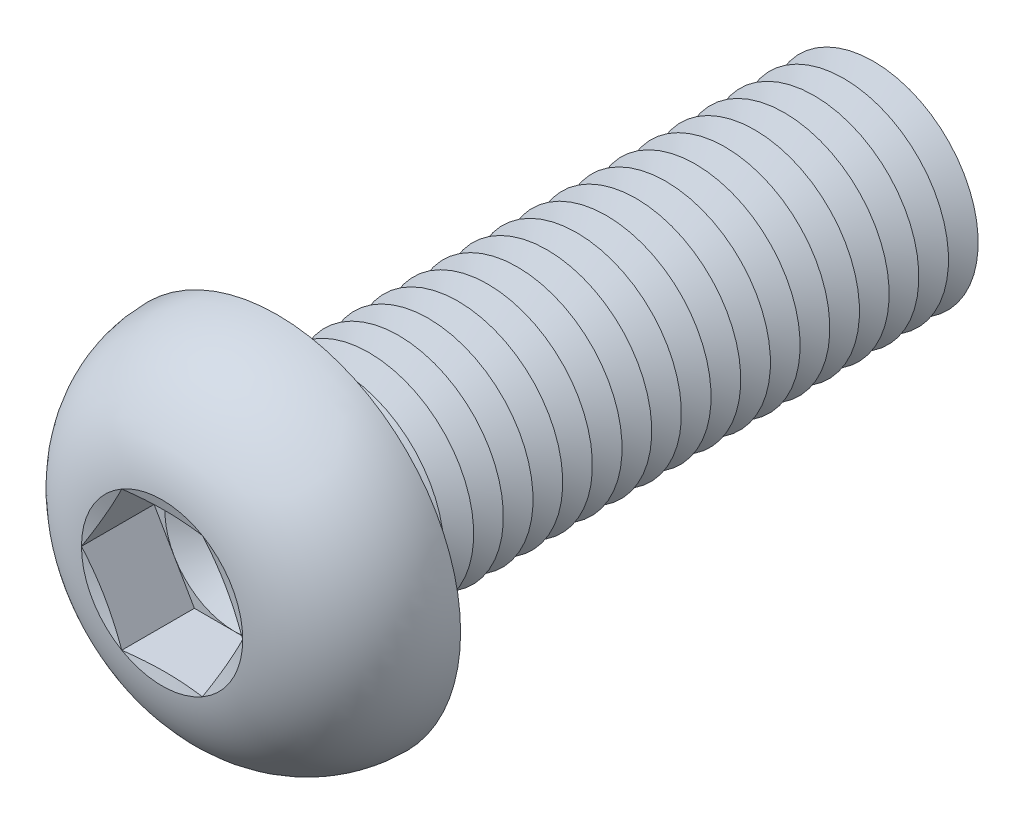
ISO-10303-21;
HEADER;
FILE_DESCRIPTION(('STEP AP214'),'2;1');
FILE_NAME('part.step','',(''),(''),'','','');
FILE_SCHEMA(('AUTOMOTIVE_DESIGN { 1 0 10303 214 1 1 1 1 }'));
ENDSEC;
DATA;
#1=APPLICATION_CONTEXT('core data for automotive mechanical design processes');
#2=APPLICATION_PROTOCOL_DEFINITION('international standard','automotive_design',2000,#1);
#3=PRODUCT_CONTEXT('',#1,'mechanical');
#4=PRODUCT('Part','Part','',(#3));
#5=PRODUCT_RELATED_PRODUCT_CATEGORY('part','',(#4));
#6=PRODUCT_DEFINITION_FORMATION('','',#4);
#7=PRODUCT_DEFINITION_CONTEXT('part definition',#1,'design');
#8=PRODUCT_DEFINITION('design','',#6,#7);
#9=PRODUCT_DEFINITION_SHAPE('','',#8);
#10=(LENGTH_UNIT() NAMED_UNIT(*) SI_UNIT(.MILLI.,.METRE.));
#11=(NAMED_UNIT(*) PLANE_ANGLE_UNIT() SI_UNIT($,.RADIAN.));
#12=(NAMED_UNIT(*) SI_UNIT($,.STERADIAN.) SOLID_ANGLE_UNIT());
#13=UNCERTAINTY_MEASURE_WITH_UNIT(LENGTH_MEASURE(1.E-05),#10,'distance_accuracy_value','');
#14=(GEOMETRIC_REPRESENTATION_CONTEXT(3) GLOBAL_UNCERTAINTY_ASSIGNED_CONTEXT((#13)) GLOBAL_UNIT_ASSIGNED_CONTEXT((#10,
#11,#12)) REPRESENTATION_CONTEXT('',''));
#15=CARTESIAN_POINT('',(0.,0.,0.));
#16=DIRECTION('',(0.,0.,1.));
#17=DIRECTION('',(1.,0.,0.));
#18=AXIS2_PLACEMENT_3D('',#15,#16,#17);
#19=CARTESIAN_POINT('',(0.,0.,2.43999999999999));
#20=DIRECTION('',(0.,0.,1.));
#21=DIRECTION('',(1.,0.,0.));
#22=AXIS2_PLACEMENT_3D('',#19,#20,#21);
#23=PLANE('',#22);
#24=CARTESIAN_POINT('',(0.,0.,2.43999999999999));
#25=DIRECTION('',(0.,0.,1.));
#26=DIRECTION('',(1.,0.,0.));
#27=AXIS2_PLACEMENT_3D('',#24,#25,#26);
#28=CIRCLE('',#27,3.99999813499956);
#29=CARTESIAN_POINT('',(3.4641,1.99999906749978,2.43999999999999));
#30=VERTEX_POINT('',#29);
#31=CARTESIAN_POINT('',(0.,3.99999813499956,2.43999999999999));
#32=VERTEX_POINT('',#31);
#33=EDGE_CURVE('E118',#30,#32,#28,.T.);
#34=ORIENTED_EDGE('',*,*,#33,.F.);
#35=DIRECTION('',(-0.5,0.866025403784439,0.));
#36=VECTOR('',#35,1.);
#37=CARTESIAN_POINT('',(4.6188,0.,2.43999999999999));
#38=LINE('',#37,#36);
#39=CARTESIAN_POINT('',(2.3094,3.99999813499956,2.43999999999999));
#40=VERTEX_POINT('',#39);
#41=EDGE_CURVE('E125',#30,#40,#38,.T.);
#42=ORIENTED_EDGE('',*,*,#41,.T.);
#43=DIRECTION('',(-1.,0.,0.));
#44=VECTOR('',#43,1.);
#45=CARTESIAN_POINT('',(2.3094,3.99999813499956,2.43999999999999));
#46=LINE('',#45,#44);
#47=EDGE_CURVE('E136',#40,#32,#46,.T.);
#48=ORIENTED_EDGE('',*,*,#47,.T.);
#49=EDGE_LOOP('',(#34,#42,#48));
#50=FACE_BOUND('',#49,.T.);
#51=ADVANCED_FACE('F39',(#50),#23,.T.);
#52=CARTESIAN_POINT('',(0.,0.,2.43999999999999));
#53=DIRECTION('',(0.,0.,1.));
#54=DIRECTION('',(1.,0.,0.));
#55=AXIS2_PLACEMENT_3D('',#52,#53,#54);
#56=CIRCLE('',#55,3.99999813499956);
#57=CARTESIAN_POINT('',(-3.4641,1.99999906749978,2.43999999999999));
#58=VERTEX_POINT('',#57);
#59=EDGE_CURVE('E11',#32,#58,#56,.T.);
#60=ORIENTED_EDGE('',*,*,#59,.F.);
#61=CARTESIAN_POINT('',(-2.3094,3.99999813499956,2.43999999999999));
#62=VERTEX_POINT('',#61);
#63=EDGE_CURVE('E131',#32,#62,#46,.T.);
#64=ORIENTED_EDGE('',*,*,#63,.T.);
#65=DIRECTION('',(-0.5,-0.866025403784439,0.));
#66=VECTOR('',#65,1.);
#67=CARTESIAN_POINT('',(-2.3094,3.99999813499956,2.43999999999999));
#68=LINE('',#67,#66);
#69=EDGE_CURVE('E134',#62,#58,#68,.T.);
#70=ORIENTED_EDGE('',*,*,#69,.T.);
#71=EDGE_LOOP('',(#60,#64,#70));
#72=FACE_BOUND('',#71,.T.);
#73=ADVANCED_FACE('F130',(#72),#23,.T.);
#74=CARTESIAN_POINT('',(-3.4641,-1.99999906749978,2.43999999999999));
#75=VERTEX_POINT('',#74);
#76=EDGE_CURVE('E49',#58,#75,#56,.T.);
#77=ORIENTED_EDGE('',*,*,#76,.F.);
#78=CARTESIAN_POINT('',(-4.6188,0.,2.43999999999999));
#79=VERTEX_POINT('',#78);
#80=EDGE_CURVE('E143',#58,#79,#68,.T.);
#81=ORIENTED_EDGE('',*,*,#80,.T.);
#82=DIRECTION('',(0.5,-0.866025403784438,0.));
#83=VECTOR('',#82,1.);
#84=CARTESIAN_POINT('',(-4.6188,0.,2.43999999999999));
#85=LINE('',#84,#83);
#86=EDGE_CURVE('E152',#79,#75,#85,.T.);
#87=ORIENTED_EDGE('',*,*,#86,.T.);
#88=EDGE_LOOP('',(#77,#81,#87));
#89=FACE_BOUND('',#88,.T.);
#90=ADVANCED_FACE('F433',(#89),#23,.T.);
#91=CARTESIAN_POINT('',(0.,-3.99999813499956,2.43999999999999));
#92=VERTEX_POINT('',#91);
#93=EDGE_CURVE('E416',#75,#92,#56,.T.);
#94=ORIENTED_EDGE('',*,*,#93,.F.);
#95=CARTESIAN_POINT('',(-2.3094,-3.99999813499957,2.43999999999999));
#96=VERTEX_POINT('',#95);
#97=EDGE_CURVE('E151',#75,#96,#85,.T.);
#98=ORIENTED_EDGE('',*,*,#97,.T.);
#99=DIRECTION('',(1.,0.,0.));
#100=VECTOR('',#99,1.);
#101=CARTESIAN_POINT('',(-2.3094,-3.99999813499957,2.43999999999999));
#102=LINE('',#101,#100);
#103=EDGE_CURVE('E157',#96,#92,#102,.T.);
#104=ORIENTED_EDGE('',*,*,#103,.T.);
#105=EDGE_LOOP('',(#94,#98,#104));
#106=FACE_BOUND('',#105,.T.);
#107=ADVANCED_FACE('F427',(#106),#23,.T.);
#108=CARTESIAN_POINT('',(3.4641,-1.99999906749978,2.43999999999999));
#109=VERTEX_POINT('',#108);
#110=EDGE_CURVE('E56',#92,#109,#56,.T.);
#111=ORIENTED_EDGE('',*,*,#110,.F.);
#112=CARTESIAN_POINT('',(2.3094,-3.99999813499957,2.43999999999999));
#113=VERTEX_POINT('',#112);
#114=EDGE_CURVE('E156',#92,#113,#102,.T.);
#115=ORIENTED_EDGE('',*,*,#114,.T.);
#116=DIRECTION('',(0.5,0.866025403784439,0.));
#117=VECTOR('',#116,1.);
#118=CARTESIAN_POINT('',(2.3094,-3.99999813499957,2.43999999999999));
#119=LINE('',#118,#117);
#120=EDGE_CURVE('E162',#113,#109,#119,.T.);
#121=ORIENTED_EDGE('',*,*,#120,.T.);
#122=EDGE_LOOP('',(#111,#115,#121));
#123=FACE_BOUND('',#122,.T.);
#124=ADVANCED_FACE('F502',(#123),#23,.T.);
#125=CARTESIAN_POINT('',(0.,0.,6.59999999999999));
#126=DIRECTION('',(0.,0.,1.));
#127=DIRECTION('',(0.,-1.,0.));
#128=AXIS2_PLACEMENT_3D('',#125,#126,#127);
#129=CONICAL_SURFACE('',#128,4.6188,1.30899693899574);
#130=CARTESIAN_POINT('',(4.61891547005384,-0.000200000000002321,6.6000309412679));
#131=CARTESIAN_POINT('',(4.52300232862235,0.165926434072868,6.57431944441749));
#132=CARTESIAN_POINT('',(4.42691527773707,0.332354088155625,6.55097758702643));
#133=CARTESIAN_POINT('',(4.23440181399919,0.665797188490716,6.50996805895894));
#134=CARTESIAN_POINT('',(4.13797527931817,0.83281284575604,6.49230269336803));
#135=CARTESIAN_POINT('',(3.94536752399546,1.16641926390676,6.46367750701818));
#136=CARTESIAN_POINT('',(3.84918760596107,1.33300776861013,6.45268354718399));
#137=CARTESIAN_POINT('',(3.6567051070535,1.66639723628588,6.4379417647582));
#138=CARTESIAN_POINT('',(3.56040255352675,1.83319815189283,6.43419253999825));
#139=CARTESIAN_POINT('',(3.36779744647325,2.16679998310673,6.43419253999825));
#140=CARTESIAN_POINT('',(3.2714948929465,2.33360089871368,6.4379417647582));
#141=CARTESIAN_POINT('',(3.07901239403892,2.66699036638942,6.45268354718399));
#142=CARTESIAN_POINT('',(2.98283247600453,2.8335788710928,6.46367750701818));
#143=CARTESIAN_POINT('',(2.79022472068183,3.16718528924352,6.49230269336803));
#144=CARTESIAN_POINT('',(2.69379818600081,3.33420094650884,6.50996805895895));
#145=CARTESIAN_POINT('',(2.50128472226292,3.66764404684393,6.55097758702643));
#146=CARTESIAN_POINT('',(2.40519767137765,3.83407170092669,6.57431944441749));
#147=CARTESIAN_POINT('',(2.30928452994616,4.00019813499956,6.6000309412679));
#148=B_SPLINE_CURVE_WITH_KNOTS('',3,(#130,#131,#132,#133,#134,#135,#136,#137,#138,#139,#140,
#141,#142,#143,#144,#145,#146,#147),.UNSPECIFIED.,.F.,.F.,(4,2,2,2,2,2,2,2,4),(0.,
0.580655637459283,1.16154676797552,1.73943971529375,2.31722080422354,2.89500189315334,
3.47289484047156,4.05378597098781,4.63444160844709),.UNSPECIFIED.);
#149=CARTESIAN_POINT('',(4.6188,0.,6.59999999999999));
#150=VERTEX_POINT('',#149);
#151=CARTESIAN_POINT('',(2.30940000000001,3.99999813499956,6.6));
#152=VERTEX_POINT('',#151);
#153=EDGE_CURVE('E221',#150,#152,#148,.T.);
#154=ORIENTED_EDGE('',*,*,#153,.F.);
#155=CARTESIAN_POINT('',(0.,0.,6.59999999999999));
#156=DIRECTION('',(0.,0.,-1.));
#157=DIRECTION('',(0.,1.,0.));
#158=AXIS2_PLACEMENT_3D('',#155,#156,#157);
#159=CIRCLE('',#158,4.6188);
#160=EDGE_CURVE('E396',#152,#150,#159,.T.);
#161=ORIENTED_EDGE('',*,*,#160,.F.);
#162=EDGE_LOOP('',(#154,#161));
#163=FACE_BOUND('',#162,.T.);
#164=ADVANCED_FACE('F506',(#163),#129,.F.);
#165=CARTESIAN_POINT('',(2.30928452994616,-4.00019813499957,6.60003094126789));
#166=CARTESIAN_POINT('',(2.40519767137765,-3.8340717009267,6.57431944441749));
#167=CARTESIAN_POINT('',(2.50128472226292,-3.66764404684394,6.55097758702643));
#168=CARTESIAN_POINT('',(2.69379818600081,-3.33420094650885,6.50996805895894));
#169=CARTESIAN_POINT('',(2.79022472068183,-3.16718528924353,6.49230269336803));
#170=CARTESIAN_POINT('',(2.98283247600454,-2.8335788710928,6.46367750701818));
#171=CARTESIAN_POINT('',(3.07901239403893,-2.66699036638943,6.45268354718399));
#172=CARTESIAN_POINT('',(3.2714948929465,-2.33360089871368,6.4379417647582));
#173=CARTESIAN_POINT('',(3.36779744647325,-2.16679998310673,6.43419253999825));
#174=CARTESIAN_POINT('',(3.56040255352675,-1.83319815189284,6.43419253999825));
#175=CARTESIAN_POINT('',(3.6567051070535,-1.66639723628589,6.4379417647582));
#176=CARTESIAN_POINT('',(3.84918760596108,-1.33300776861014,6.45268354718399));
#177=CARTESIAN_POINT('',(3.94536752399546,-1.16641926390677,6.46367750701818));
#178=CARTESIAN_POINT('',(4.13797527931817,-0.832812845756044,6.49230269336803));
#179=CARTESIAN_POINT('',(4.23440181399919,-0.66579718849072,6.50996805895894));
#180=CARTESIAN_POINT('',(4.42691527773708,-0.332354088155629,6.55097758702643));
#181=CARTESIAN_POINT('',(4.52300232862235,-0.165926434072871,6.57431944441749));
#182=CARTESIAN_POINT('',(4.61891547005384,0.000199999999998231,6.6000309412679));
#183=B_SPLINE_CURVE_WITH_KNOTS('',3,(#165,#166,#167,#168,#169,#170,#171,#172,#173,#174,#175,
#176,#177,#178,#179,#180,#181,#182),.UNSPECIFIED.,.F.,.F.,(4,2,2,2,2,2,2,2,4),(0.,
0.580655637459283,1.16154676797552,1.73943971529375,2.31722080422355,2.89500189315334,
3.47289484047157,4.05378597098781,4.63444160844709),.UNSPECIFIED.);
#184=CARTESIAN_POINT('',(2.3094,-3.99999813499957,6.59999999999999));
#185=VERTEX_POINT('',#184);
#186=EDGE_CURVE('E230',#185,#150,#183,.T.);
#187=ORIENTED_EDGE('',*,*,#186,.F.);
#188=EDGE_CURVE('E401',#150,#185,#159,.T.);
#189=ORIENTED_EDGE('',*,*,#188,.F.);
#190=EDGE_LOOP('',(#187,#189));
#191=FACE_BOUND('',#190,.T.);
#192=ADVANCED_FACE('F468',(#191),#129,.F.);
#193=CARTESIAN_POINT('',(-6.96966750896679,-3.99999813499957,7.51561854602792));
#194=CARTESIAN_POINT('',(-6.80094634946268,-3.99999813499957,7.47641178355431));
#195=CARTESIAN_POINT('',(-6.63214895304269,-3.99999813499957,7.43753277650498));
#196=CARTESIAN_POINT('',(-6.29436999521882,-3.99999813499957,7.36057075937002));
#197=CARTESIAN_POINT('',(-6.12538843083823,-3.99999813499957,7.3224877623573));
#198=CARTESIAN_POINT('',(-5.61806276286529,-3.99999813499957,7.20963087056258));
#199=CARTESIAN_POINT('',(-5.27940301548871,-3.99999813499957,7.13626437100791));
#200=CARTESIAN_POINT('',(-4.5977576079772,-3.99999813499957,6.99431141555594));
#201=CARTESIAN_POINT('',(-4.25476115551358,-3.99999813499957,6.92577621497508));
#202=CARTESIAN_POINT('',(-3.56716783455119,-3.99999813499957,6.79696563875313));
#203=CARTESIAN_POINT('',(-3.22257082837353,-3.99999813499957,6.73669098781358));
#204=CARTESIAN_POINT('',(-2.54069952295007,-3.99999813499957,6.63002020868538));
#205=CARTESIAN_POINT('',(-2.20347918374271,-3.99999813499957,6.58329286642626));
#206=CARTESIAN_POINT('',(-1.6962445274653,-3.99999813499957,6.52585827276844));
#207=CARTESIAN_POINT('',(-1.52694760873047,-3.99999813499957,6.50882377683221));
#208=CARTESIAN_POINT('',(-1.187938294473,-3.99999813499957,6.47963274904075));
#209=CARTESIAN_POINT('',(-1.01822592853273,-3.99999813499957,6.4674758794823));
#210=CARTESIAN_POINT('',(-0.679233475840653,-3.99999813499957,6.44863176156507));
#211=CARTESIAN_POINT('',(-0.509954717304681,-3.99999813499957,6.44192096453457));
#212=CARTESIAN_POINT('',(-0.171265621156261,-3.99999813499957,6.43422163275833));
#213=CARTESIAN_POINT('',(-0.0018552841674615,-3.99999813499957,6.43323307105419));
#214=CARTESIAN_POINT('',(0.336912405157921,-3.99999813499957,6.43703123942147));
#215=CARTESIAN_POINT('',(0.506269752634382,-3.99999813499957,6.44181839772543));
#216=CARTESIAN_POINT('',(0.844732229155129,-3.99999813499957,6.45691823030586));
#217=CARTESIAN_POINT('',(1.0138373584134,-3.99999813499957,6.46723089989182));
#218=CARTESIAN_POINT('',(1.42449950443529,-3.99999813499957,6.49843349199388));
#219=CARTESIAN_POINT('',(1.66585565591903,-3.99999813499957,6.52196685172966));
#220=CARTESIAN_POINT('',(2.14755410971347,-3.99999813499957,6.57749710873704));
#221=CARTESIAN_POINT('',(2.3878964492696,-3.99999813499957,6.60949369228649));
#222=CARTESIAN_POINT('',(2.86835569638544,-3.99999813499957,6.68017769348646));
#223=CARTESIAN_POINT('',(3.10846949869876,-3.99999813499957,6.71888590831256));
#224=CARTESIAN_POINT('',(3.5878341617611,-3.99999813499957,6.80132981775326));
#225=CARTESIAN_POINT('',(3.82708497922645,-3.99999813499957,6.84506576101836));
#226=CARTESIAN_POINT('',(4.30977392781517,-3.99999813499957,6.93726543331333));
#227=CARTESIAN_POINT('',(4.55319689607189,-3.99999813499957,6.98580793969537));
#228=CARTESIAN_POINT('',(5.03943022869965,-3.99999813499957,7.08586668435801));
#229=CARTESIAN_POINT('',(5.28224058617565,-3.99999813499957,7.13738295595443));
#230=CARTESIAN_POINT('',(5.76604885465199,-3.99999813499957,7.24238429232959));
#231=CARTESIAN_POINT('',(6.00704943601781,-3.99999813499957,7.29585711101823));
#232=CARTESIAN_POINT('',(6.48863948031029,-3.99999813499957,7.4045482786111));
#233=CARTESIAN_POINT('',(6.72922897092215,-3.99999813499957,7.45976650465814));
#234=CARTESIAN_POINT('',(6.9696675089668,-3.99999813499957,7.51561854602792));
#235=B_SPLINE_CURVE_WITH_KNOTS('',3,(#193,#194,#195,#196,#197,#198,#199,#200,#201,#202,#203,
#204,#205,#206,#207,#208,#209,#210,#211,#212,#213,#214,#215,#216,#217,#218,#219,#220,#221,#222,
#223,#224,#225,#226,#227,#228,#229,#230,#231,#232,#233,#234),.UNSPECIFIED.,.F.,.F.,(4,2,2,2,2,2,
2,2,2,2,2,2,2,2,2,2,2,2,2,2,4),(0.,0.519649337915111,1.03930720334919,2.07882421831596,
3.12808572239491,4.17743921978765,5.19841727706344,5.7088142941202,6.21917596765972,
6.7273189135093,7.23545946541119,7.74363769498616,8.25181549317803,8.9791183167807,
9.70639418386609,10.4359652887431,11.1655724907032,11.910195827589,12.6548275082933,
13.395405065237,14.1359306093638),.UNSPECIFIED.);
#236=CARTESIAN_POINT('',(-2.3094,-3.99999813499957,6.59999999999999));
#237=VERTEX_POINT('',#236);
#238=EDGE_CURVE('E446',#237,#185,#235,.T.);
#239=ORIENTED_EDGE('',*,*,#238,.F.);
#240=EDGE_CURVE('E459',#185,#237,#159,.T.);
#241=ORIENTED_EDGE('',*,*,#240,.F.);
#242=EDGE_LOOP('',(#239,#241));
#243=FACE_BOUND('',#242,.T.);
#244=ADVANCED_FACE('F474',(#243),#129,.F.);
#245=CARTESIAN_POINT('',(-4.61891547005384,0.000199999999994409,6.6000309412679));
#246=CARTESIAN_POINT('',(-4.52300232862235,-0.165926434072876,6.57431944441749));
#247=CARTESIAN_POINT('',(-4.42691527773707,-0.332354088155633,6.55097758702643));
#248=CARTESIAN_POINT('',(-4.23440181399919,-0.665797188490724,6.50996805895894));
#249=CARTESIAN_POINT('',(-4.13797527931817,-0.832812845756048,6.49230269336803));
#250=CARTESIAN_POINT('',(-3.94536752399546,-1.16641926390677,6.46367750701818));
#251=CARTESIAN_POINT('',(-3.84918760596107,-1.33300776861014,6.45268354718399));
#252=CARTESIAN_POINT('',(-3.6567051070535,-1.66639723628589,6.4379417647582));
#253=CARTESIAN_POINT('',(-3.56040255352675,-1.83319815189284,6.43419253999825));
#254=CARTESIAN_POINT('',(-3.36779744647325,-2.16679998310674,6.43419253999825));
#255=CARTESIAN_POINT('',(-3.2714948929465,-2.33360089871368,6.4379417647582));
#256=CARTESIAN_POINT('',(-3.07901239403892,-2.66699036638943,6.45268354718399));
#257=CARTESIAN_POINT('',(-2.98283247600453,-2.83357887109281,6.46367750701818));
#258=CARTESIAN_POINT('',(-2.79022472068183,-3.16718528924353,6.49230269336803));
#259=CARTESIAN_POINT('',(-2.69379818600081,-3.33420094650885,6.50996805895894));
#260=CARTESIAN_POINT('',(-2.50128472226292,-3.66764404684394,6.55097758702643));
#261=CARTESIAN_POINT('',(-2.40519767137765,-3.8340717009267,6.57431944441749));
#262=CARTESIAN_POINT('',(-2.30928452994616,-4.00019813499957,6.60003094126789));
#263=B_SPLINE_CURVE_WITH_KNOTS('',3,(#245,#246,#247,#248,#249,#250,#251,#252,#253,#254,#255,
#256,#257,#258,#259,#260,#261,#262),.UNSPECIFIED.,.F.,.F.,(4,2,2,2,2,2,2,2,4),(0.,
0.580655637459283,1.16154676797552,1.73943971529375,2.31722080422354,2.89500189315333,
3.47289484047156,4.05378597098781,4.63444160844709),.UNSPECIFIED.);
#264=CARTESIAN_POINT('',(-4.6188,0.,6.59999999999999));
#265=VERTEX_POINT('',#264);
#266=EDGE_CURVE('E438',#265,#237,#263,.T.);
#267=ORIENTED_EDGE('',*,*,#266,.F.);
#268=EDGE_CURVE('E444',#237,#265,#159,.T.);
#269=ORIENTED_EDGE('',*,*,#268,.F.);
#270=EDGE_LOOP('',(#267,#269));
#271=FACE_BOUND('',#270,.T.);
#272=ADVANCED_FACE('F442',(#271),#129,.F.);
#273=CARTESIAN_POINT('',(-2.30928452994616,4.00019813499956,6.6000309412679));
#274=CARTESIAN_POINT('',(-2.40519767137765,3.83407170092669,6.57431944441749));
#275=CARTESIAN_POINT('',(-2.50128472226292,3.66764404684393,6.55097758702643));
#276=CARTESIAN_POINT('',(-2.69379818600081,3.33420094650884,6.50996805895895));
#277=CARTESIAN_POINT('',(-2.79022472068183,3.16718528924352,6.49230269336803));
#278=CARTESIAN_POINT('',(-2.98283247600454,2.8335788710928,6.46367750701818));
#279=CARTESIAN_POINT('',(-3.07901239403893,2.66699036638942,6.45268354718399));
#280=CARTESIAN_POINT('',(-3.2714948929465,2.33360089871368,6.4379417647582));
#281=CARTESIAN_POINT('',(-3.36779744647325,2.16679998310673,6.43419253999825));
#282=CARTESIAN_POINT('',(-3.56040255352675,1.83319815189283,6.43419253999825));
#283=CARTESIAN_POINT('',(-3.6567051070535,1.66639723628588,6.4379417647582));
#284=CARTESIAN_POINT('',(-3.84918760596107,1.33300776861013,6.45268354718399));
#285=CARTESIAN_POINT('',(-3.94536752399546,1.16641926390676,6.46367750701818));
#286=CARTESIAN_POINT('',(-4.13797527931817,0.832812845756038,6.49230269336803));
#287=CARTESIAN_POINT('',(-4.23440181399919,0.665797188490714,6.50996805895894));
#288=CARTESIAN_POINT('',(-4.42691527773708,0.332354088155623,6.55097758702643));
#289=CARTESIAN_POINT('',(-4.52300232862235,0.165926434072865,6.57431944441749));
#290=CARTESIAN_POINT('',(-4.61891547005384,-0.000200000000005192,6.6000309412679));
#291=B_SPLINE_CURVE_WITH_KNOTS('',3,(#273,#274,#275,#276,#277,#278,#279,#280,#281,#282,#283,
#284,#285,#286,#287,#288,#289,#290),.UNSPECIFIED.,.F.,.F.,(4,2,2,2,2,2,2,2,4),(0.,
0.580655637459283,1.16154676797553,1.73943971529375,2.31722080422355,2.89500189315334,
3.47289484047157,4.05378597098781,4.63444160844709),.UNSPECIFIED.);
#292=CARTESIAN_POINT('',(-2.3094,3.99999813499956,6.59999999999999));
#293=VERTEX_POINT('',#292);
#294=EDGE_CURVE('E194',#293,#265,#291,.T.);
#295=ORIENTED_EDGE('',*,*,#294,.F.);
#296=EDGE_CURVE('E449',#265,#293,#159,.T.);
#297=ORIENTED_EDGE('',*,*,#296,.F.);
#298=EDGE_LOOP('',(#295,#297));
#299=FACE_BOUND('',#298,.T.);
#300=ADVANCED_FACE('F450',(#299),#129,.F.);
#301=CARTESIAN_POINT('',(0.,0.,-29.05));
#302=DIRECTION('',(0.,0.,1.));
#303=DIRECTION('',(0.,-1.,0.));
#304=AXIS2_PLACEMENT_3D('',#301,#302,#303);
#305=CONICAL_SURFACE('',#304,5.99999999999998,1.0471975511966);
#306=CARTESIAN_POINT('',(0.,0.,-29.9));
#307=DIRECTION('',(0.,0.,1.));
#308=DIRECTION('',(0.,-1.,0.));
#309=AXIS2_PLACEMENT_3D('',#306,#307,#308);
#310=CIRCLE('',#309,4.52775681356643);
#311=CARTESIAN_POINT('',(0.,-4.52775681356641,-29.9));
#312=VERTEX_POINT('',#311);
#313=EDGE_CURVE('E367',#312,#312,#310,.T.);
#314=ORIENTED_EDGE('',*,*,#313,.T.);
#315=EDGE_LOOP('',(#314));
#316=FACE_BOUND('',#315,.T.);
#317=CARTESIAN_POINT('',(0.,0.,-29.05));
#318=DIRECTION('',(0.,0.,1.));
#319=DIRECTION('',(0.,-1.,0.));
#320=AXIS2_PLACEMENT_3D('',#317,#318,#319);
#321=CIRCLE('',#320,5.99999999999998);
#322=CARTESIAN_POINT('',(0.,-5.99999999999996,-29.05));
#323=VERTEX_POINT('',#322);
#324=EDGE_CURVE('E363',#323,#323,#321,.T.);
#325=ORIENTED_EDGE('',*,*,#324,.F.);
#326=EDGE_LOOP('',(#325));
#327=FACE_BOUND('',#326,.T.);
#328=ADVANCED_FACE('F534',(#316,#327),#305,.T.);
#329=CARTESIAN_POINT('',(0.,0.,-29.9));
#330=DIRECTION('',(0.,0.,-1.));
#331=DIRECTION('',(0.,1.,0.));
#332=AXIS2_PLACEMENT_3D('',#329,#330,#331);
#333=CONICAL_SURFACE('',#332,4.52775681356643,1.0471975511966);
#334=CARTESIAN_POINT('',(0.,0.,-30.75));
#335=DIRECTION('',(0.,0.,1.));
#336=DIRECTION('',(0.,-1.,0.));
#337=AXIS2_PLACEMENT_3D('',#334,#335,#336);
#338=CIRCLE('',#337,5.99999999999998);
#339=CARTESIAN_POINT('',(0.,-5.99999999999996,-30.75));
#340=VERTEX_POINT('',#339);
#341=EDGE_CURVE('E371',#340,#340,#338,.T.);
#342=ORIENTED_EDGE('',*,*,#341,.T.);
#343=EDGE_LOOP('',(#342));
#344=FACE_BOUND('',#343,.T.);
#345=ORIENTED_EDGE('',*,*,#313,.F.);
#346=EDGE_LOOP('',(#345));
#347=FACE_BOUND('',#346,.T.);
#348=ADVANCED_FACE('F539',(#344,#347),#333,.T.);
#349=CARTESIAN_POINT('',(0.,6.,-35.));
#350=DIRECTION('',(0.,0.,-1.));
#351=DIRECTION('',(0.,1.,0.));
#352=AXIS2_PLACEMENT_3D('',#349,#350,#351);
#353=PLANE('',#352);
#354=CARTESIAN_POINT('',(0.,0.,-35.));
#355=DIRECTION('',(0.,0.,1.));
#356=DIRECTION('',(0.,-1.,0.));
#357=AXIS2_PLACEMENT_3D('',#354,#355,#356);
#358=CIRCLE('',#357,4.52775681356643);
#359=CARTESIAN_POINT('',(0.,-4.52775681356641,-35.));
#360=VERTEX_POINT('',#359);
#361=EDGE_CURVE('E391',#360,#360,#358,.T.);
#362=ORIENTED_EDGE('',*,*,#361,.F.);
#363=EDGE_LOOP('',(#362));
#364=FACE_BOUND('',#363,.T.);
#365=ADVANCED_FACE('F714',(#364),#353,.T.);
#366=CARTESIAN_POINT('',(0.,0.,-34.15));
#367=DIRECTION('',(0.,0.,1.));
#368=DIRECTION('',(0.,-1.,0.));
#369=AXIS2_PLACEMENT_3D('',#366,#367,#368);
#370=CONICAL_SURFACE('',#369,5.99999999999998,1.0471975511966);
#371=ORIENTED_EDGE('',*,*,#361,.T.);
#372=EDGE_LOOP('',(#371));
#373=FACE_BOUND('',#372,.T.);
#374=CARTESIAN_POINT('',(0.,0.,-34.15));
#375=DIRECTION('',(0.,0.,1.));
#376=DIRECTION('',(0.,-1.,0.));
#377=AXIS2_PLACEMENT_3D('',#374,#375,#376);
#378=CIRCLE('',#377,5.99999999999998);
#379=CARTESIAN_POINT('',(0.,-5.99999999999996,-34.15));
#380=VERTEX_POINT('',#379);
#381=EDGE_CURVE('E387',#380,#380,#378,.T.);
#382=ORIENTED_EDGE('',*,*,#381,.F.);
#383=EDGE_LOOP('',(#382));
#384=FACE_BOUND('',#383,.T.);
#385=ADVANCED_FACE('F707',(#373,#384),#370,.T.);
#386=CARTESIAN_POINT('',(0.,0.,-33.3));
#387=DIRECTION('',(0.,0.,-1.));
#388=DIRECTION('',(0.,1.,0.));
#389=AXIS2_PLACEMENT_3D('',#386,#387,#388);
#390=CONICAL_SURFACE('',#389,4.52775681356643,1.0471975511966);
#391=ORIENTED_EDGE('',*,*,#381,.T.);
#392=EDGE_LOOP('',(#391));
#393=FACE_BOUND('',#392,.T.);
#394=CARTESIAN_POINT('',(0.,0.,-33.3));
#395=DIRECTION('',(0.,0.,1.));
#396=DIRECTION('',(0.,-1.,0.));
#397=AXIS2_PLACEMENT_3D('',#394,#395,#396);
#398=CIRCLE('',#397,4.52775681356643);
#399=CARTESIAN_POINT('',(0.,-4.52775681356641,-33.3));
#400=VERTEX_POINT('',#399);
#401=EDGE_CURVE('E383',#400,#400,#398,.T.);
#402=ORIENTED_EDGE('',*,*,#401,.F.);
#403=EDGE_LOOP('',(#402));
#404=FACE_BOUND('',#403,.T.);
#405=ADVANCED_FACE('F713',(#393,#404),#390,.T.);
#406=CARTESIAN_POINT('',(0.,0.,-32.45));
#407=DIRECTION('',(0.,0.,1.));
#408=DIRECTION('',(0.,-1.,0.));
#409=AXIS2_PLACEMENT_3D('',#406,#407,#408);
#410=CONICAL_SURFACE('',#409,5.99999999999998,1.0471975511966);
#411=ORIENTED_EDGE('',*,*,#401,.T.);
#412=EDGE_LOOP('',(#411));
#413=FACE_BOUND('',#412,.T.);
#414=CARTESIAN_POINT('',(0.,0.,-32.45));
#415=DIRECTION('',(0.,0.,1.));
#416=DIRECTION('',(0.,-1.,0.));
#417=AXIS2_PLACEMENT_3D('',#414,#415,#416);
#418=CIRCLE('',#417,5.99999999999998);
#419=CARTESIAN_POINT('',(0.,-5.99999999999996,-32.45));
#420=VERTEX_POINT('',#419);
#421=EDGE_CURVE('E379',#420,#420,#418,.T.);
#422=ORIENTED_EDGE('',*,*,#421,.F.);
#423=EDGE_LOOP('',(#422));
#424=FACE_BOUND('',#423,.T.);
#425=ADVANCED_FACE('F745',(#413,#424),#410,.T.);
#426=CARTESIAN_POINT('',(0.,0.,-31.6));
#427=DIRECTION('',(0.,0.,-1.));
#428=DIRECTION('',(0.,1.,0.));
#429=AXIS2_PLACEMENT_3D('',#426,#427,#428);
#430=CONICAL_SURFACE('',#429,4.52775681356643,1.0471975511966);
#431=ORIENTED_EDGE('',*,*,#421,.T.);
#432=EDGE_LOOP('',(#431));
#433=FACE_BOUND('',#432,.T.);
#434=CARTESIAN_POINT('',(0.,0.,-31.6));
#435=DIRECTION('',(0.,0.,1.));
#436=DIRECTION('',(0.,-1.,0.));
#437=AXIS2_PLACEMENT_3D('',#434,#435,#436);
#438=CIRCLE('',#437,4.52775681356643);
#439=CARTESIAN_POINT('',(0.,-4.52775681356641,-31.6));
#440=VERTEX_POINT('',#439);
#441=EDGE_CURVE('E375',#440,#440,#438,.T.);
#442=ORIENTED_EDGE('',*,*,#441,.F.);
#443=EDGE_LOOP('',(#442));
#444=FACE_BOUND('',#443,.T.);
#445=ADVANCED_FACE('F755',(#433,#444),#430,.T.);
#446=CARTESIAN_POINT('',(0.,0.,-30.75));
#447=DIRECTION('',(0.,0.,1.));
#448=DIRECTION('',(0.,-1.,0.));
#449=AXIS2_PLACEMENT_3D('',#446,#447,#448);
#450=CONICAL_SURFACE('',#449,5.99999999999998,1.0471975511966);
#451=ORIENTED_EDGE('',*,*,#441,.T.);
#452=EDGE_LOOP('',(#451));
#453=FACE_BOUND('',#452,.T.);
#454=ORIENTED_EDGE('',*,*,#341,.F.);
#455=EDGE_LOOP('',(#454));
#456=FACE_BOUND('',#455,.T.);
#457=ADVANCED_FACE('F765',(#453,#456),#450,.T.);
#458=CARTESIAN_POINT('',(0.,0.,-27.35));
#459=DIRECTION('',(0.,0.,1.));
#460=DIRECTION('',(0.,-1.,0.));
#461=AXIS2_PLACEMENT_3D('',#458,#459,#460);
#462=CONICAL_SURFACE('',#461,5.99999999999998,1.0471975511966);
#463=CARTESIAN_POINT('',(0.,0.,-28.2));
#464=DIRECTION('',(0.,0.,1.));
#465=DIRECTION('',(0.,-1.,0.));
#466=AXIS2_PLACEMENT_3D('',#463,#464,#465);
#467=CIRCLE('',#466,4.52775681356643);
#468=CARTESIAN_POINT('',(0.,-4.52775681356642,-28.2));
#469=VERTEX_POINT('',#468);
#470=EDGE_CURVE('E359',#469,#469,#467,.T.);
#471=ORIENTED_EDGE('',*,*,#470,.T.);
#472=EDGE_LOOP('',(#471));
#473=FACE_BOUND('',#472,.T.);
#474=CARTESIAN_POINT('',(0.,0.,-27.35));
#475=DIRECTION('',(0.,0.,1.));
#476=DIRECTION('',(0.,-1.,0.));
#477=AXIS2_PLACEMENT_3D('',#474,#475,#476);
#478=CIRCLE('',#477,5.99999999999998);
#479=CARTESIAN_POINT('',(0.,-5.99999999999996,-27.35));
#480=VERTEX_POINT('',#479);
#481=EDGE_CURVE('E355',#480,#480,#478,.T.);
#482=ORIENTED_EDGE('',*,*,#481,.F.);
#483=EDGE_LOOP('',(#482));
#484=FACE_BOUND('',#483,.T.);
#485=ADVANCED_FACE('F775',(#473,#484),#462,.T.);
#486=CARTESIAN_POINT('',(0.,0.,-28.2));
#487=DIRECTION('',(0.,0.,-1.));
#488=DIRECTION('',(0.,1.,0.));
#489=AXIS2_PLACEMENT_3D('',#486,#487,#488);
#490=CONICAL_SURFACE('',#489,4.52775681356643,1.0471975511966);
#491=ORIENTED_EDGE('',*,*,#324,.T.);
#492=EDGE_LOOP('',(#491));
#493=FACE_BOUND('',#492,.T.);
#494=ORIENTED_EDGE('',*,*,#470,.F.);
#495=EDGE_LOOP('',(#494));
#496=FACE_BOUND('',#495,.T.);
#497=ADVANCED_FACE('F785',(#493,#496),#490,.T.);
#498=CARTESIAN_POINT('',(0.,0.,-25.65));
#499=DIRECTION('',(0.,0.,1.));
#500=DIRECTION('',(0.,-1.,0.));
#501=AXIS2_PLACEMENT_3D('',#498,#499,#500);
#502=CONICAL_SURFACE('',#501,5.99999999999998,1.0471975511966);
#503=CARTESIAN_POINT('',(0.,0.,-26.5));
#504=DIRECTION('',(0.,0.,1.));
#505=DIRECTION('',(0.,-1.,0.));
#506=AXIS2_PLACEMENT_3D('',#503,#504,#505);
#507=CIRCLE('',#506,4.52775681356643);
#508=CARTESIAN_POINT('',(0.,-4.52775681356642,-26.5));
#509=VERTEX_POINT('',#508);
#510=EDGE_CURVE('E351',#509,#509,#507,.T.);
#511=ORIENTED_EDGE('',*,*,#510,.T.);
#512=EDGE_LOOP('',(#511));
#513=FACE_BOUND('',#512,.T.);
#514=CARTESIAN_POINT('',(0.,0.,-25.65));
#515=DIRECTION('',(0.,0.,1.));
#516=DIRECTION('',(0.,-1.,0.));
#517=AXIS2_PLACEMENT_3D('',#514,#515,#516);
#518=CIRCLE('',#517,5.99999999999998);
#519=CARTESIAN_POINT('',(0.,-5.99999999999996,-25.65));
#520=VERTEX_POINT('',#519);
#521=EDGE_CURVE('E347',#520,#520,#518,.T.);
#522=ORIENTED_EDGE('',*,*,#521,.F.);
#523=EDGE_LOOP('',(#522));
#524=FACE_BOUND('',#523,.T.);
#525=ADVANCED_FACE('F795',(#513,#524),#502,.T.);
#526=CARTESIAN_POINT('',(0.,0.,-26.5));
#527=DIRECTION('',(0.,0.,-1.));
#528=DIRECTION('',(0.,1.,0.));
#529=AXIS2_PLACEMENT_3D('',#526,#527,#528);
#530=CONICAL_SURFACE('',#529,4.52775681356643,1.0471975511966);
#531=ORIENTED_EDGE('',*,*,#481,.T.);
#532=EDGE_LOOP('',(#531));
#533=FACE_BOUND('',#532,.T.);
#534=ORIENTED_EDGE('',*,*,#510,.F.);
#535=EDGE_LOOP('',(#534));
#536=FACE_BOUND('',#535,.T.);
#537=ADVANCED_FACE('F805',(#533,#536),#530,.T.);
#538=CARTESIAN_POINT('',(0.,0.,-23.95));
#539=DIRECTION('',(0.,0.,1.));
#540=DIRECTION('',(0.,-1.,0.));
#541=AXIS2_PLACEMENT_3D('',#538,#539,#540);
#542=CONICAL_SURFACE('',#541,5.99999999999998,1.0471975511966);
#543=CARTESIAN_POINT('',(0.,0.,-24.8));
#544=DIRECTION('',(0.,0.,1.));
#545=DIRECTION('',(0.,-1.,0.));
#546=AXIS2_PLACEMENT_3D('',#543,#544,#545);
#547=CIRCLE('',#546,4.52775681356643);
#548=CARTESIAN_POINT('',(0.,-4.52775681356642,-24.8));
#549=VERTEX_POINT('',#548);
#550=EDGE_CURVE('E343',#549,#549,#547,.T.);
#551=ORIENTED_EDGE('',*,*,#550,.T.);
#552=EDGE_LOOP('',(#551));
#553=FACE_BOUND('',#552,.T.);
#554=CARTESIAN_POINT('',(0.,0.,-23.95));
#555=DIRECTION('',(0.,0.,1.));
#556=DIRECTION('',(0.,-1.,0.));
#557=AXIS2_PLACEMENT_3D('',#554,#555,#556);
#558=CIRCLE('',#557,5.99999999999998);
#559=CARTESIAN_POINT('',(0.,-5.99999999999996,-23.95));
#560=VERTEX_POINT('',#559);
#561=EDGE_CURVE('E339',#560,#560,#558,.T.);
#562=ORIENTED_EDGE('',*,*,#561,.F.);
#563=EDGE_LOOP('',(#562));
#564=FACE_BOUND('',#563,.T.);
#565=ADVANCED_FACE('F815',(#553,#564),#542,.T.);
#566=CARTESIAN_POINT('',(0.,0.,-24.8));
#567=DIRECTION('',(0.,0.,-1.));
#568=DIRECTION('',(0.,1.,0.));
#569=AXIS2_PLACEMENT_3D('',#566,#567,#568);
#570=CONICAL_SURFACE('',#569,4.52775681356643,1.0471975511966);
#571=ORIENTED_EDGE('',*,*,#521,.T.);
#572=EDGE_LOOP('',(#571));
#573=FACE_BOUND('',#572,.T.);
#574=ORIENTED_EDGE('',*,*,#550,.F.);
#575=EDGE_LOOP('',(#574));
#576=FACE_BOUND('',#575,.T.);
#577=ADVANCED_FACE('F825',(#573,#576),#570,.T.);
#578=CARTESIAN_POINT('',(0.,0.,-22.25));
#579=DIRECTION('',(0.,0.,1.));
#580=DIRECTION('',(0.,-1.,0.));
#581=AXIS2_PLACEMENT_3D('',#578,#579,#580);
#582=CONICAL_SURFACE('',#581,5.99999999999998,1.0471975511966);
#583=CARTESIAN_POINT('',(0.,0.,-23.1));
#584=DIRECTION('',(0.,0.,1.));
#585=DIRECTION('',(0.,-1.,0.));
#586=AXIS2_PLACEMENT_3D('',#583,#584,#585);
#587=CIRCLE('',#586,4.52775681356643);
#588=CARTESIAN_POINT('',(0.,-4.52775681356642,-23.1));
#589=VERTEX_POINT('',#588);
#590=EDGE_CURVE('E335',#589,#589,#587,.T.);
#591=ORIENTED_EDGE('',*,*,#590,.T.);
#592=EDGE_LOOP('',(#591));
#593=FACE_BOUND('',#592,.T.);
#594=CARTESIAN_POINT('',(0.,0.,-22.25));
#595=DIRECTION('',(0.,0.,1.));
#596=DIRECTION('',(0.,-1.,0.));
#597=AXIS2_PLACEMENT_3D('',#594,#595,#596);
#598=CIRCLE('',#597,5.99999999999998);
#599=CARTESIAN_POINT('',(0.,-5.99999999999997,-22.25));
#600=VERTEX_POINT('',#599);
#601=EDGE_CURVE('E331',#600,#600,#598,.T.);
#602=ORIENTED_EDGE('',*,*,#601,.F.);
#603=EDGE_LOOP('',(#602));
#604=FACE_BOUND('',#603,.T.);
#605=ADVANCED_FACE('F835',(#593,#604),#582,.T.);
#606=CARTESIAN_POINT('',(0.,0.,-23.1));
#607=DIRECTION('',(0.,0.,-1.));
#608=DIRECTION('',(0.,1.,0.));
#609=AXIS2_PLACEMENT_3D('',#606,#607,#608);
#610=CONICAL_SURFACE('',#609,4.52775681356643,1.0471975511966);
#611=ORIENTED_EDGE('',*,*,#561,.T.);
#612=EDGE_LOOP('',(#611));
#613=FACE_BOUND('',#612,.T.);
#614=ORIENTED_EDGE('',*,*,#590,.F.);
#615=EDGE_LOOP('',(#614));
#616=FACE_BOUND('',#615,.T.);
#617=ADVANCED_FACE('F845',(#613,#616),#610,.T.);
#618=CARTESIAN_POINT('',(0.,0.,-20.55));
#619=DIRECTION('',(0.,0.,1.));
#620=DIRECTION('',(0.,-1.,0.));
#621=AXIS2_PLACEMENT_3D('',#618,#619,#620);
#622=CONICAL_SURFACE('',#621,5.99999999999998,1.0471975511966);
#623=CARTESIAN_POINT('',(0.,0.,-21.4));
#624=DIRECTION('',(0.,0.,1.));
#625=DIRECTION('',(0.,-1.,0.));
#626=AXIS2_PLACEMENT_3D('',#623,#624,#625);
#627=CIRCLE('',#626,4.52775681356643);
#628=CARTESIAN_POINT('',(0.,-4.52775681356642,-21.4));
#629=VERTEX_POINT('',#628);
#630=EDGE_CURVE('E328',#629,#629,#627,.T.);
#631=ORIENTED_EDGE('',*,*,#630,.T.);
#632=EDGE_LOOP('',(#631));
#633=FACE_BOUND('',#632,.T.);
#634=CARTESIAN_POINT('',(0.,0.,-20.55));
#635=DIRECTION('',(0.,0.,1.));
#636=DIRECTION('',(0.,-1.,0.));
#637=AXIS2_PLACEMENT_3D('',#634,#635,#636);
#638=CIRCLE('',#637,5.99999999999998);
#639=CARTESIAN_POINT('',(0.,-5.99999999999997,-20.55));
#640=VERTEX_POINT('',#639);
#641=EDGE_CURVE('E324',#640,#640,#638,.T.);
#642=ORIENTED_EDGE('',*,*,#641,.F.);
#643=EDGE_LOOP('',(#642));
#644=FACE_BOUND('',#643,.T.);
#645=ADVANCED_FACE('F855',(#633,#644),#622,.T.);
#646=CARTESIAN_POINT('',(0.,0.,-21.4));
#647=DIRECTION('',(0.,0.,-1.));
#648=DIRECTION('',(0.,1.,0.));
#649=AXIS2_PLACEMENT_3D('',#646,#647,#648);
#650=CONICAL_SURFACE('',#649,4.52775681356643,1.0471975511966);
#651=ORIENTED_EDGE('',*,*,#601,.T.);
#652=EDGE_LOOP('',(#651));
#653=FACE_BOUND('',#652,.T.);
#654=ORIENTED_EDGE('',*,*,#630,.F.);
#655=EDGE_LOOP('',(#654));
#656=FACE_BOUND('',#655,.T.);
#657=ADVANCED_FACE('F865',(#653,#656),#650,.T.);
#658=CARTESIAN_POINT('',(0.,0.,-18.85));
#659=DIRECTION('',(0.,0.,1.));
#660=DIRECTION('',(0.,-1.,0.));
#661=AXIS2_PLACEMENT_3D('',#658,#659,#660);
#662=CONICAL_SURFACE('',#661,5.99999999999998,1.0471975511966);
#663=CARTESIAN_POINT('',(0.,0.,-19.7));
#664=DIRECTION('',(0.,0.,1.));
#665=DIRECTION('',(0.,-1.,0.));
#666=AXIS2_PLACEMENT_3D('',#663,#664,#665);
#667=CIRCLE('',#666,4.52775681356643);
#668=CARTESIAN_POINT('',(0.,-4.52775681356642,-19.7));
#669=VERTEX_POINT('',#668);
#670=EDGE_CURVE('E320',#669,#669,#667,.T.);
#671=ORIENTED_EDGE('',*,*,#670,.T.);
#672=EDGE_LOOP('',(#671));
#673=FACE_BOUND('',#672,.T.);
#674=CARTESIAN_POINT('',(0.,0.,-18.85));
#675=DIRECTION('',(0.,0.,1.));
#676=DIRECTION('',(0.,-1.,0.));
#677=AXIS2_PLACEMENT_3D('',#674,#675,#676);
#678=CIRCLE('',#677,5.99999999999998);
#679=CARTESIAN_POINT('',(0.,-5.99999999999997,-18.85));
#680=VERTEX_POINT('',#679);
#681=EDGE_CURVE('E316',#680,#680,#678,.T.);
#682=ORIENTED_EDGE('',*,*,#681,.F.);
#683=EDGE_LOOP('',(#682));
#684=FACE_BOUND('',#683,.T.);
#685=ADVANCED_FACE('F875',(#673,#684),#662,.T.);
#686=CARTESIAN_POINT('',(0.,0.,-19.7));
#687=DIRECTION('',(0.,0.,-1.));
#688=DIRECTION('',(0.,1.,0.));
#689=AXIS2_PLACEMENT_3D('',#686,#687,#688);
#690=CONICAL_SURFACE('',#689,4.52775681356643,1.0471975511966);
#691=ORIENTED_EDGE('',*,*,#641,.T.);
#692=EDGE_LOOP('',(#691));
#693=FACE_BOUND('',#692,.T.);
#694=ORIENTED_EDGE('',*,*,#670,.F.);
#695=EDGE_LOOP('',(#694));
#696=FACE_BOUND('',#695,.T.);
#697=ADVANCED_FACE('F885',(#693,#696),#690,.T.);
#698=CARTESIAN_POINT('',(0.,0.,-17.15));
#699=DIRECTION('',(0.,0.,1.));
#700=DIRECTION('',(0.,-1.,0.));
#701=AXIS2_PLACEMENT_3D('',#698,#699,#700);
#702=CONICAL_SURFACE('',#701,5.99999999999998,1.0471975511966);
#703=CARTESIAN_POINT('',(0.,0.,-18.));
#704=DIRECTION('',(0.,0.,1.));
#705=DIRECTION('',(0.,-1.,0.));
#706=AXIS2_PLACEMENT_3D('',#703,#704,#705);
#707=CIRCLE('',#706,4.52775681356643);
#708=CARTESIAN_POINT('',(0.,-4.52775681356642,-18.));
#709=VERTEX_POINT('',#708);
#710=EDGE_CURVE('E312',#709,#709,#707,.T.);
#711=ORIENTED_EDGE('',*,*,#710,.T.);
#712=EDGE_LOOP('',(#711));
#713=FACE_BOUND('',#712,.T.);
#714=CARTESIAN_POINT('',(0.,0.,-17.15));
#715=DIRECTION('',(0.,0.,1.));
#716=DIRECTION('',(0.,-1.,0.));
#717=AXIS2_PLACEMENT_3D('',#714,#715,#716);
#718=CIRCLE('',#717,5.99999999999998);
#719=CARTESIAN_POINT('',(0.,-5.99999999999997,-17.15));
#720=VERTEX_POINT('',#719);
#721=EDGE_CURVE('E308',#720,#720,#718,.T.);
#722=ORIENTED_EDGE('',*,*,#721,.F.);
#723=EDGE_LOOP('',(#722));
#724=FACE_BOUND('',#723,.T.);
#725=ADVANCED_FACE('F895',(#713,#724),#702,.T.);
#726=CARTESIAN_POINT('',(0.,0.,-18.));
#727=DIRECTION('',(0.,0.,-1.));
#728=DIRECTION('',(0.,1.,0.));
#729=AXIS2_PLACEMENT_3D('',#726,#727,#728);
#730=CONICAL_SURFACE('',#729,4.52775681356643,1.0471975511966);
#731=ORIENTED_EDGE('',*,*,#681,.T.);
#732=EDGE_LOOP('',(#731));
#733=FACE_BOUND('',#732,.T.);
#734=ORIENTED_EDGE('',*,*,#710,.F.);
#735=EDGE_LOOP('',(#734));
#736=FACE_BOUND('',#735,.T.);
#737=ADVANCED_FACE('F905',(#733,#736),#730,.T.);
#738=CARTESIAN_POINT('',(0.,0.,-15.45));
#739=DIRECTION('',(0.,0.,1.));
#740=DIRECTION('',(0.,-1.,0.));
#741=AXIS2_PLACEMENT_3D('',#738,#739,#740);
#742=CONICAL_SURFACE('',#741,5.99999999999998,1.0471975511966);
#743=CARTESIAN_POINT('',(0.,0.,-16.3));
#744=DIRECTION('',(0.,0.,1.));
#745=DIRECTION('',(0.,-1.,0.));
#746=AXIS2_PLACEMENT_3D('',#743,#744,#745);
#747=CIRCLE('',#746,4.52775681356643);
#748=CARTESIAN_POINT('',(0.,-4.52775681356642,-16.3));
#749=VERTEX_POINT('',#748);
#750=EDGE_CURVE('E304',#749,#749,#747,.T.);
#751=ORIENTED_EDGE('',*,*,#750,.T.);
#752=EDGE_LOOP('',(#751));
#753=FACE_BOUND('',#752,.T.);
#754=CARTESIAN_POINT('',(0.,0.,-15.45));
#755=DIRECTION('',(0.,0.,1.));
#756=DIRECTION('',(0.,-1.,0.));
#757=AXIS2_PLACEMENT_3D('',#754,#755,#756);
#758=CIRCLE('',#757,5.99999999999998);
#759=CARTESIAN_POINT('',(0.,-5.99999999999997,-15.45));
#760=VERTEX_POINT('',#759);
#761=EDGE_CURVE('E300',#760,#760,#758,.T.);
#762=ORIENTED_EDGE('',*,*,#761,.F.);
#763=EDGE_LOOP('',(#762));
#764=FACE_BOUND('',#763,.T.);
#765=ADVANCED_FACE('F915',(#753,#764),#742,.T.);
#766=CARTESIAN_POINT('',(0.,0.,-16.3));
#767=DIRECTION('',(0.,0.,-1.));
#768=DIRECTION('',(0.,1.,0.));
#769=AXIS2_PLACEMENT_3D('',#766,#767,#768);
#770=CONICAL_SURFACE('',#769,4.52775681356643,1.0471975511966);
#771=ORIENTED_EDGE('',*,*,#721,.T.);
#772=EDGE_LOOP('',(#771));
#773=FACE_BOUND('',#772,.T.);
#774=ORIENTED_EDGE('',*,*,#750,.F.);
#775=EDGE_LOOP('',(#774));
#776=FACE_BOUND('',#775,.T.);
#777=ADVANCED_FACE('F925',(#773,#776),#770,.T.);
#778=CARTESIAN_POINT('',(0.,0.,-13.75));
#779=DIRECTION('',(0.,0.,1.));
#780=DIRECTION('',(0.,-1.,0.));
#781=AXIS2_PLACEMENT_3D('',#778,#779,#780);
#782=CONICAL_SURFACE('',#781,5.99999999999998,1.0471975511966);
#783=CARTESIAN_POINT('',(0.,0.,-14.6));
#784=DIRECTION('',(0.,0.,1.));
#785=DIRECTION('',(0.,-1.,0.));
#786=AXIS2_PLACEMENT_3D('',#783,#784,#785);
#787=CIRCLE('',#786,4.52775681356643);
#788=CARTESIAN_POINT('',(0.,-4.52775681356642,-14.6));
#789=VERTEX_POINT('',#788);
#790=EDGE_CURVE('E296',#789,#789,#787,.T.);
#791=ORIENTED_EDGE('',*,*,#790,.T.);
#792=EDGE_LOOP('',(#791));
#793=FACE_BOUND('',#792,.T.);
#794=CARTESIAN_POINT('',(0.,0.,-13.75));
#795=DIRECTION('',(0.,0.,1.));
#796=DIRECTION('',(0.,-1.,0.));
#797=AXIS2_PLACEMENT_3D('',#794,#795,#796);
#798=CIRCLE('',#797,5.99999999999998);
#799=CARTESIAN_POINT('',(0.,-5.99999999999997,-13.75));
#800=VERTEX_POINT('',#799);
#801=EDGE_CURVE('E292',#800,#800,#798,.T.);
#802=ORIENTED_EDGE('',*,*,#801,.F.);
#803=EDGE_LOOP('',(#802));
#804=FACE_BOUND('',#803,.T.);
#805=ADVANCED_FACE('F935',(#793,#804),#782,.T.);
#806=CARTESIAN_POINT('',(0.,0.,-14.6));
#807=DIRECTION('',(0.,0.,-1.));
#808=DIRECTION('',(0.,1.,0.));
#809=AXIS2_PLACEMENT_3D('',#806,#807,#808);
#810=CONICAL_SURFACE('',#809,4.52775681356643,1.0471975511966);
#811=ORIENTED_EDGE('',*,*,#761,.T.);
#812=EDGE_LOOP('',(#811));
#813=FACE_BOUND('',#812,.T.);
#814=ORIENTED_EDGE('',*,*,#790,.F.);
#815=EDGE_LOOP('',(#814));
#816=FACE_BOUND('',#815,.T.);
#817=ADVANCED_FACE('F945',(#813,#816),#810,.T.);
#818=CARTESIAN_POINT('',(0.,0.,-12.05));
#819=DIRECTION('',(0.,0.,1.));
#820=DIRECTION('',(0.,-1.,0.));
#821=AXIS2_PLACEMENT_3D('',#818,#819,#820);
#822=CONICAL_SURFACE('',#821,5.99999999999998,1.0471975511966);
#823=CARTESIAN_POINT('',(0.,0.,-12.9));
#824=DIRECTION('',(0.,0.,1.));
#825=DIRECTION('',(0.,-1.,0.));
#826=AXIS2_PLACEMENT_3D('',#823,#824,#825);
#827=CIRCLE('',#826,4.52775681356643);
#828=CARTESIAN_POINT('',(0.,-4.52775681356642,-12.9));
#829=VERTEX_POINT('',#828);
#830=EDGE_CURVE('E288',#829,#829,#827,.T.);
#831=ORIENTED_EDGE('',*,*,#830,.T.);
#832=EDGE_LOOP('',(#831));
#833=FACE_BOUND('',#832,.T.);
#834=CARTESIAN_POINT('',(0.,0.,-12.05));
#835=DIRECTION('',(0.,0.,1.));
#836=DIRECTION('',(0.,-1.,0.));
#837=AXIS2_PLACEMENT_3D('',#834,#835,#836);
#838=CIRCLE('',#837,5.99999999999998);
#839=CARTESIAN_POINT('',(0.,-5.99999999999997,-12.05));
#840=VERTEX_POINT('',#839);
#841=EDGE_CURVE('E284',#840,#840,#838,.T.);
#842=ORIENTED_EDGE('',*,*,#841,.F.);
#843=EDGE_LOOP('',(#842));
#844=FACE_BOUND('',#843,.T.);
#845=ADVANCED_FACE('F955',(#833,#844),#822,.T.);
#846=CARTESIAN_POINT('',(0.,0.,-12.9));
#847=DIRECTION('',(0.,0.,-1.));
#848=DIRECTION('',(0.,1.,0.));
#849=AXIS2_PLACEMENT_3D('',#846,#847,#848);
#850=CONICAL_SURFACE('',#849,4.52775681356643,1.0471975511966);
#851=ORIENTED_EDGE('',*,*,#801,.T.);
#852=EDGE_LOOP('',(#851));
#853=FACE_BOUND('',#852,.T.);
#854=ORIENTED_EDGE('',*,*,#830,.F.);
#855=EDGE_LOOP('',(#854));
#856=FACE_BOUND('',#855,.T.);
#857=ADVANCED_FACE('F965',(#853,#856),#850,.T.);
#858=CARTESIAN_POINT('',(0.,0.,-10.35));
#859=DIRECTION('',(0.,0.,1.));
#860=DIRECTION('',(0.,-1.,0.));
#861=AXIS2_PLACEMENT_3D('',#858,#859,#860);
#862=CONICAL_SURFACE('',#861,5.99999999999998,1.0471975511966);
#863=CARTESIAN_POINT('',(0.,0.,-11.2));
#864=DIRECTION('',(0.,0.,1.));
#865=DIRECTION('',(0.,-1.,0.));
#866=AXIS2_PLACEMENT_3D('',#863,#864,#865);
#867=CIRCLE('',#866,4.52775681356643);
#868=CARTESIAN_POINT('',(0.,-4.52775681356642,-11.2));
#869=VERTEX_POINT('',#868);
#870=EDGE_CURVE('E280',#869,#869,#867,.T.);
#871=ORIENTED_EDGE('',*,*,#870,.T.);
#872=EDGE_LOOP('',(#871));
#873=FACE_BOUND('',#872,.T.);
#874=CARTESIAN_POINT('',(0.,0.,-10.35));
#875=DIRECTION('',(0.,0.,1.));
#876=DIRECTION('',(0.,-1.,0.));
#877=AXIS2_PLACEMENT_3D('',#874,#875,#876);
#878=CIRCLE('',#877,5.99999999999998);
#879=CARTESIAN_POINT('',(0.,-5.99999999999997,-10.35));
#880=VERTEX_POINT('',#879);
#881=EDGE_CURVE('E276',#880,#880,#878,.T.);
#882=ORIENTED_EDGE('',*,*,#881,.F.);
#883=EDGE_LOOP('',(#882));
#884=FACE_BOUND('',#883,.T.);
#885=ADVANCED_FACE('F975',(#873,#884),#862,.T.);
#886=CARTESIAN_POINT('',(0.,0.,-11.2));
#887=DIRECTION('',(0.,0.,-1.));
#888=DIRECTION('',(0.,1.,0.));
#889=AXIS2_PLACEMENT_3D('',#886,#887,#888);
#890=CONICAL_SURFACE('',#889,4.52775681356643,1.0471975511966);
#891=ORIENTED_EDGE('',*,*,#841,.T.);
#892=EDGE_LOOP('',(#891));
#893=FACE_BOUND('',#892,.T.);
#894=ORIENTED_EDGE('',*,*,#870,.F.);
#895=EDGE_LOOP('',(#894));
#896=FACE_BOUND('',#895,.T.);
#897=ADVANCED_FACE('F985',(#893,#896),#890,.T.);
#898=CARTESIAN_POINT('',(0.,0.,-8.65));
#899=DIRECTION('',(0.,0.,1.));
#900=DIRECTION('',(0.,-1.,0.));
#901=AXIS2_PLACEMENT_3D('',#898,#899,#900);
#902=CONICAL_SURFACE('',#901,5.99999999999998,1.0471975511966);
#903=CARTESIAN_POINT('',(0.,0.,-9.50000000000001));
#904=DIRECTION('',(0.,0.,1.));
#905=DIRECTION('',(0.,-1.,0.));
#906=AXIS2_PLACEMENT_3D('',#903,#904,#905);
#907=CIRCLE('',#906,4.52775681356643);
#908=CARTESIAN_POINT('',(0.,-4.52775681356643,-9.50000000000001));
#909=VERTEX_POINT('',#908);
#910=EDGE_CURVE('E272',#909,#909,#907,.T.);
#911=ORIENTED_EDGE('',*,*,#910,.T.);
#912=EDGE_LOOP('',(#911));
#913=FACE_BOUND('',#912,.T.);
#914=CARTESIAN_POINT('',(0.,0.,-8.65000000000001));
#915=DIRECTION('',(0.,0.,1.));
#916=DIRECTION('',(0.,-1.,0.));
#917=AXIS2_PLACEMENT_3D('',#914,#915,#916);
#918=CIRCLE('',#917,5.99999999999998);
#919=CARTESIAN_POINT('',(0.,-5.99999999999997,-8.65000000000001));
#920=VERTEX_POINT('',#919);
#921=EDGE_CURVE('E268',#920,#920,#918,.T.);
#922=ORIENTED_EDGE('',*,*,#921,.F.);
#923=EDGE_LOOP('',(#922));
#924=FACE_BOUND('',#923,.T.);
#925=ADVANCED_FACE('F995',(#913,#924),#902,.T.);
#926=CARTESIAN_POINT('',(0.,0.,-9.50000000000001));
#927=DIRECTION('',(0.,0.,-1.));
#928=DIRECTION('',(0.,1.,0.));
#929=AXIS2_PLACEMENT_3D('',#926,#927,#928);
#930=CONICAL_SURFACE('',#929,4.52775681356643,1.0471975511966);
#931=ORIENTED_EDGE('',*,*,#881,.T.);
#932=EDGE_LOOP('',(#931));
#933=FACE_BOUND('',#932,.T.);
#934=ORIENTED_EDGE('',*,*,#910,.F.);
#935=EDGE_LOOP('',(#934));
#936=FACE_BOUND('',#935,.T.);
#937=ADVANCED_FACE('F1005',(#933,#936),#930,.T.);
#938=CARTESIAN_POINT('',(0.,0.,-6.95));
#939=DIRECTION('',(0.,0.,1.));
#940=DIRECTION('',(0.,-1.,0.));
#941=AXIS2_PLACEMENT_3D('',#938,#939,#940);
#942=CONICAL_SURFACE('',#941,5.99999999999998,1.0471975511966);
#943=CARTESIAN_POINT('',(0.,0.,-7.80000000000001));
#944=DIRECTION('',(0.,0.,1.));
#945=DIRECTION('',(0.,-1.,0.));
#946=AXIS2_PLACEMENT_3D('',#943,#944,#945);
#947=CIRCLE('',#946,4.52775681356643);
#948=CARTESIAN_POINT('',(0.,-4.52775681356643,-7.80000000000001));
#949=VERTEX_POINT('',#948);
#950=EDGE_CURVE('E264',#949,#949,#947,.T.);
#951=ORIENTED_EDGE('',*,*,#950,.T.);
#952=EDGE_LOOP('',(#951));
#953=FACE_BOUND('',#952,.T.);
#954=CARTESIAN_POINT('',(0.,0.,-6.95000000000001));
#955=DIRECTION('',(0.,0.,1.));
#956=DIRECTION('',(0.,-1.,0.));
#957=AXIS2_PLACEMENT_3D('',#954,#955,#956);
#958=CIRCLE('',#957,5.99999999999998);
#959=CARTESIAN_POINT('',(0.,-5.99999999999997,-6.95000000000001));
#960=VERTEX_POINT('',#959);
#961=EDGE_CURVE('E260',#960,#960,#958,.T.);
#962=ORIENTED_EDGE('',*,*,#961,.F.);
#963=EDGE_LOOP('',(#962));
#964=FACE_BOUND('',#963,.T.);
#965=ADVANCED_FACE('F1015',(#953,#964),#942,.T.);
#966=CARTESIAN_POINT('',(0.,0.,-7.80000000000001));
#967=DIRECTION('',(0.,0.,-1.));
#968=DIRECTION('',(0.,1.,0.));
#969=AXIS2_PLACEMENT_3D('',#966,#967,#968);
#970=CONICAL_SURFACE('',#969,4.52775681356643,1.0471975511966);
#971=ORIENTED_EDGE('',*,*,#921,.T.);
#972=EDGE_LOOP('',(#971));
#973=FACE_BOUND('',#972,.T.);
#974=ORIENTED_EDGE('',*,*,#950,.F.);
#975=EDGE_LOOP('',(#974));
#976=FACE_BOUND('',#975,.T.);
#977=ADVANCED_FACE('F1025',(#973,#976),#970,.T.);
#978=CARTESIAN_POINT('',(0.,0.,-5.25));
#979=DIRECTION('',(0.,0.,1.));
#980=DIRECTION('',(0.,-1.,0.));
#981=AXIS2_PLACEMENT_3D('',#978,#979,#980);
#982=CONICAL_SURFACE('',#981,5.99999999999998,1.0471975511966);
#983=CARTESIAN_POINT('',(0.,0.,-6.1));
#984=DIRECTION('',(0.,0.,1.));
#985=DIRECTION('',(0.,-1.,0.));
#986=AXIS2_PLACEMENT_3D('',#983,#984,#985);
#987=CIRCLE('',#986,4.52775681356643);
#988=CARTESIAN_POINT('',(0.,-4.52775681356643,-6.10000000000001));
#989=VERTEX_POINT('',#988);
#990=EDGE_CURVE('E256',#989,#989,#987,.T.);
#991=ORIENTED_EDGE('',*,*,#990,.T.);
#992=EDGE_LOOP('',(#991));
#993=FACE_BOUND('',#992,.T.);
#994=CARTESIAN_POINT('',(0.,0.,-5.25000000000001));
#995=DIRECTION('',(0.,0.,1.));
#996=DIRECTION('',(0.,-1.,0.));
#997=AXIS2_PLACEMENT_3D('',#994,#995,#996);
#998=CIRCLE('',#997,5.99999999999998);
#999=CARTESIAN_POINT('',(0.,-5.99999999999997,-5.25000000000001));
#1000=VERTEX_POINT('',#999);
#1001=EDGE_CURVE('E252',#1000,#1000,#998,.T.);
#1002=ORIENTED_EDGE('',*,*,#1001,.F.);
#1003=EDGE_LOOP('',(#1002));
#1004=FACE_BOUND('',#1003,.T.);
#1005=ADVANCED_FACE('F1035',(#993,#1004),#982,.T.);
#1006=CARTESIAN_POINT('',(0.,0.,-6.1));
#1007=DIRECTION('',(0.,0.,-1.));
#1008=DIRECTION('',(0.,1.,0.));
#1009=AXIS2_PLACEMENT_3D('',#1006,#1007,#1008);
#1010=CONICAL_SURFACE('',#1009,4.52775681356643,1.0471975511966);
#1011=ORIENTED_EDGE('',*,*,#961,.T.);
#1012=EDGE_LOOP('',(#1011));
#1013=FACE_BOUND('',#1012,.T.);
#1014=ORIENTED_EDGE('',*,*,#990,.F.);
#1015=EDGE_LOOP('',(#1014));
#1016=FACE_BOUND('',#1015,.T.);
#1017=ADVANCED_FACE('F1045',(#1013,#1016),#1010,.T.);
#1018=CARTESIAN_POINT('',(0.,0.,-3.55));
#1019=DIRECTION('',(0.,0.,1.));
#1020=DIRECTION('',(0.,-1.,0.));
#1021=AXIS2_PLACEMENT_3D('',#1018,#1019,#1020);
#1022=CONICAL_SURFACE('',#1021,5.99999999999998,1.0471975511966);
#1023=CARTESIAN_POINT('',(0.,0.,-4.4));
#1024=DIRECTION('',(0.,0.,1.));
#1025=DIRECTION('',(0.,-1.,0.));
#1026=AXIS2_PLACEMENT_3D('',#1023,#1024,#1025);
#1027=CIRCLE('',#1026,4.52775681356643);
#1028=CARTESIAN_POINT('',(0.,-4.52775681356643,-4.40000000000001));
#1029=VERTEX_POINT('',#1028);
#1030=EDGE_CURVE('E248',#1029,#1029,#1027,.T.);
#1031=ORIENTED_EDGE('',*,*,#1030,.T.);
#1032=EDGE_LOOP('',(#1031));
#1033=FACE_BOUND('',#1032,.T.);
#1034=CARTESIAN_POINT('',(0.,0.,-3.55000000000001));
#1035=DIRECTION('',(0.,0.,1.));
#1036=DIRECTION('',(0.,-1.,0.));
#1037=AXIS2_PLACEMENT_3D('',#1034,#1035,#1036);
#1038=CIRCLE('',#1037,5.99999999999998);
#1039=CARTESIAN_POINT('',(0.,-5.99999999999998,-3.55000000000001));
#1040=VERTEX_POINT('',#1039);
#1041=EDGE_CURVE('E240',#1040,#1040,#1038,.T.);
#1042=ORIENTED_EDGE('',*,*,#1041,.F.);
#1043=EDGE_LOOP('',(#1042));
#1044=FACE_BOUND('',#1043,.T.);
#1045=ADVANCED_FACE('F1055',(#1033,#1044),#1022,.T.);
#1046=CARTESIAN_POINT('',(0.,0.,-4.4));
#1047=DIRECTION('',(0.,0.,-1.));
#1048=DIRECTION('',(0.,1.,0.));
#1049=AXIS2_PLACEMENT_3D('',#1046,#1047,#1048);
#1050=CONICAL_SURFACE('',#1049,4.52775681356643,1.0471975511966);
#1051=ORIENTED_EDGE('',*,*,#1001,.T.);
#1052=EDGE_LOOP('',(#1051));
#1053=FACE_BOUND('',#1052,.T.);
#1054=ORIENTED_EDGE('',*,*,#1030,.F.);
#1055=EDGE_LOOP('',(#1054));
#1056=FACE_BOUND('',#1055,.T.);
#1057=ADVANCED_FACE('F1065',(#1053,#1056),#1050,.T.);
#1058=CARTESIAN_POINT('',(0.,0.,-1.85));
#1059=DIRECTION('',(0.,0.,1.));
#1060=DIRECTION('',(0.,-1.,0.));
#1061=AXIS2_PLACEMENT_3D('',#1058,#1059,#1060);
#1062=CONICAL_SURFACE('',#1061,5.99999999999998,1.0471975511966);
#1063=CARTESIAN_POINT('',(0.,0.,-2.70000000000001));
#1064=DIRECTION('',(0.,0.,1.));
#1065=DIRECTION('',(0.,-1.,0.));
#1066=AXIS2_PLACEMENT_3D('',#1063,#1064,#1065);
#1067=CIRCLE('',#1066,4.52775681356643);
#1068=CARTESIAN_POINT('',(0.,-4.52775681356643,-2.70000000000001));
#1069=VERTEX_POINT('',#1068);
#1070=EDGE_CURVE('E229',#1069,#1069,#1067,.T.);
#1071=ORIENTED_EDGE('',*,*,#1070,.T.);
#1072=EDGE_LOOP('',(#1071));
#1073=FACE_BOUND('',#1072,.T.);
#1074=CARTESIAN_POINT('',(0.,0.,-1.85));
#1075=DIRECTION('',(0.,0.,1.));
#1076=DIRECTION('',(0.,-1.,0.));
#1077=AXIS2_PLACEMENT_3D('',#1074,#1075,#1076);
#1078=CIRCLE('',#1077,5.99999999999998);
#1079=CARTESIAN_POINT('',(0.,-5.99999999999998,-1.85000000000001));
#1080=VERTEX_POINT('',#1079);
#1081=EDGE_CURVE('E244',#1080,#1080,#1078,.T.);
#1082=ORIENTED_EDGE('',*,*,#1081,.F.);
#1083=EDGE_LOOP('',(#1082));
#1084=FACE_BOUND('',#1083,.T.);
#1085=ADVANCED_FACE('F531',(#1073,#1084),#1062,.T.);
#1086=CARTESIAN_POINT('',(0.,0.,-2.70000000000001));
#1087=DIRECTION('',(0.,0.,-1.));
#1088=DIRECTION('',(0.,1.,0.));
#1089=AXIS2_PLACEMENT_3D('',#1086,#1087,#1088);
#1090=CONICAL_SURFACE('',#1089,4.52775681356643,1.0471975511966);
#1091=ORIENTED_EDGE('',*,*,#1041,.T.);
#1092=EDGE_LOOP('',(#1091));
#1093=FACE_BOUND('',#1092,.T.);
#1094=ORIENTED_EDGE('',*,*,#1070,.F.);
#1095=EDGE_LOOP('',(#1094));
#1096=FACE_BOUND('',#1095,.T.);
#1097=ADVANCED_FACE('F218',(#1093,#1096),#1090,.T.);
#1098=CARTESIAN_POINT('',(6.9696675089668,3.99999813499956,7.51561854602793));
#1099=CARTESIAN_POINT('',(6.80094634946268,3.99999813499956,7.47641178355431));
#1100=CARTESIAN_POINT('',(6.63214895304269,3.99999813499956,7.43753277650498));
#1101=CARTESIAN_POINT('',(6.29436999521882,3.99999813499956,7.36057075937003));
#1102=CARTESIAN_POINT('',(6.12538843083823,3.99999813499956,7.3224877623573));
#1103=CARTESIAN_POINT('',(5.61806276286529,3.99999813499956,7.20963087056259));
#1104=CARTESIAN_POINT('',(5.27940301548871,3.99999813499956,7.13626437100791));
#1105=CARTESIAN_POINT('',(4.5977576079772,3.99999813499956,6.99431141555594));
#1106=CARTESIAN_POINT('',(4.25476115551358,3.99999813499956,6.92577621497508));
#1107=CARTESIAN_POINT('',(3.56716783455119,3.99999813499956,6.79696563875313));
#1108=CARTESIAN_POINT('',(3.22257082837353,3.99999813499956,6.73669098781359));
#1109=CARTESIAN_POINT('',(2.54069952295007,3.99999813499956,6.63002020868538));
#1110=CARTESIAN_POINT('',(2.20347918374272,3.99999813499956,6.58329286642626));
#1111=CARTESIAN_POINT('',(1.69624452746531,3.99999813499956,6.52585827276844));
#1112=CARTESIAN_POINT('',(1.52694760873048,3.99999813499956,6.50882377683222));
#1113=CARTESIAN_POINT('',(1.18793829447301,3.99999813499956,6.47963274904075));
#1114=CARTESIAN_POINT('',(1.01822592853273,3.99999813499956,6.4674758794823));
#1115=CARTESIAN_POINT('',(0.679233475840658,3.99999813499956,6.44863176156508));
#1116=CARTESIAN_POINT('',(0.509954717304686,3.99999813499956,6.44192096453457));
#1117=CARTESIAN_POINT('',(0.171265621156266,3.99999813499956,6.43422163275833));
#1118=CARTESIAN_POINT('',(0.00185528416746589,3.99999813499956,6.43323307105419));
#1119=CARTESIAN_POINT('',(-0.336912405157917,3.99999813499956,6.43703123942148));
#1120=CARTESIAN_POINT('',(-0.506269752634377,3.99999813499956,6.44181839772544));
#1121=CARTESIAN_POINT('',(-0.844732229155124,3.99999813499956,6.45691823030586));
#1122=CARTESIAN_POINT('',(-1.01383735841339,3.99999813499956,6.46723089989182));
#1123=CARTESIAN_POINT('',(-1.42449950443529,3.99999813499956,6.49843349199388));
#1124=CARTESIAN_POINT('',(-1.66585565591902,3.99999813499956,6.52196685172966));
#1125=CARTESIAN_POINT('',(-2.14755410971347,3.99999813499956,6.57749710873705));
#1126=CARTESIAN_POINT('',(-2.3878964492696,3.99999813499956,6.60949369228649));
#1127=CARTESIAN_POINT('',(-2.86835569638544,3.99999813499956,6.68017769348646));
#1128=CARTESIAN_POINT('',(-3.10846949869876,3.99999813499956,6.71888590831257));
#1129=CARTESIAN_POINT('',(-3.58783416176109,3.99999813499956,6.80132981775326));
#1130=CARTESIAN_POINT('',(-3.82708497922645,3.99999813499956,6.84506576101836));
#1131=CARTESIAN_POINT('',(-4.30977392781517,3.99999813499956,6.93726543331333));
#1132=CARTESIAN_POINT('',(-4.55319689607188,3.99999813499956,6.98580793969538));
#1133=CARTESIAN_POINT('',(-5.03943022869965,3.99999813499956,7.08586668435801));
#1134=CARTESIAN_POINT('',(-5.28224058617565,3.99999813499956,7.13738295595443));
#1135=CARTESIAN_POINT('',(-5.76604885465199,3.99999813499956,7.2423842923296));
#1136=CARTESIAN_POINT('',(-6.00704943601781,3.99999813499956,7.29585711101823));
#1137=CARTESIAN_POINT('',(-6.48863948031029,3.99999813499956,7.4045482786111));
#1138=CARTESIAN_POINT('',(-6.72922897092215,3.99999813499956,7.45976650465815));
#1139=CARTESIAN_POINT('',(-6.9696675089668,3.99999813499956,7.51561854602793));
#1140=B_SPLINE_CURVE_WITH_KNOTS('',3,(#1098,#1099,#1100,#1101,#1102,#1103,#1104,#1105,#1106,
#1107,#1108,#1109,#1110,#1111,#1112,#1113,#1114,#1115,#1116,#1117,#1118,#1119,#1120,#1121,#1122,
#1123,#1124,#1125,#1126,#1127,#1128,#1129,#1130,#1131,#1132,#1133,#1134,#1135,#1136,#1137,#1138,
#1139),.UNSPECIFIED.,.F.,.F.,(4,2,2,2,2,2,2,2,2,2,2,2,2,2,2,2,2,2,2,2,4),(0.,0.519649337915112,
1.03930720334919,2.07882421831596,3.12808572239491,4.17743921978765,5.19841727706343,
5.7088142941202,6.21917596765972,6.7273189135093,7.23545946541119,7.74363769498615,
8.25181549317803,8.9791183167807,9.7063941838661,10.4359652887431,11.1655724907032,
11.910195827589,12.6548275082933,13.395405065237,14.1359306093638),.UNSPECIFIED.);
#1141=EDGE_CURVE('E170',#152,#293,#1140,.T.);
#1142=ORIENTED_EDGE('',*,*,#1141,.F.);
#1143=EDGE_CURVE('E395',#293,#152,#159,.T.);
#1144=ORIENTED_EDGE('',*,*,#1143,.F.);
#1145=EDGE_LOOP('',(#1142,#1144));
#1146=FACE_BOUND('',#1145,.T.);
#1147=ADVANCED_FACE('F201',(#1146),#129,.F.);
#1148=CARTESIAN_POINT('',(0.,0.,0.));
#1149=DIRECTION('',(0.,0.,-1.));
#1150=DIRECTION('',(0.,1.,0.));
#1151=AXIS2_PLACEMENT_3D('',#1148,#1149,#1150);
#1152=DEGENERATE_TOROIDAL_SURFACE('',#1151,3.85607414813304,6.64392585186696,.T.);
#1153=ORIENTED_EDGE('',*,*,#160,.T.);
#1154=ORIENTED_EDGE('',*,*,#188,.T.);
#1155=ORIENTED_EDGE('',*,*,#240,.T.);
#1156=ORIENTED_EDGE('',*,*,#268,.T.);
#1157=ORIENTED_EDGE('',*,*,#296,.T.);
#1158=ORIENTED_EDGE('',*,*,#1143,.T.);
#1159=EDGE_LOOP('',(#1153,#1154,#1155,#1156,#1157,#1158));
#1160=FACE_BOUND('',#1159,.T.);
#1161=CARTESIAN_POINT('',(0.,0.,0.));
#1162=DIRECTION('',(0.,0.,-1.));
#1163=DIRECTION('',(0.,1.,0.));
#1164=AXIS2_PLACEMENT_3D('',#1161,#1162,#1163);
#1165=CIRCLE('',#1164,10.5);
#1166=CARTESIAN_POINT('',(0.,10.5,0.));
#1167=VERTEX_POINT('',#1166);
#1168=EDGE_CURVE('E400',#1167,#1167,#1165,.T.);
#1169=ORIENTED_EDGE('',*,*,#1168,.F.);
#1170=EDGE_LOOP('',(#1169));
#1171=FACE_BOUND('',#1170,.T.);
#1172=ADVANCED_FACE('F455',(#1160,#1171),#1152,.T.);
#1173=CARTESIAN_POINT('',(0.,6.,0.));
#1174=DIRECTION('',(0.,0.,-1.));
#1175=DIRECTION('',(0.,1.,0.));
#1176=AXIS2_PLACEMENT_3D('',#1173,#1174,#1175);
#1177=PLANE('',#1176);
#1178=CARTESIAN_POINT('',(0.,0.,0.));
#1179=DIRECTION('',(0.,0.,-1.));
#1180=DIRECTION('',(0.,1.,0.));
#1181=AXIS2_PLACEMENT_3D('',#1178,#1179,#1180);
#1182=CIRCLE('',#1181,6.84999999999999);
#1183=CARTESIAN_POINT('',(0.,6.84999999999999,0.));
#1184=VERTEX_POINT('',#1183);
#1185=EDGE_CURVE('E408',#1184,#1184,#1182,.F.);
#1186=ORIENTED_EDGE('',*,*,#1185,.T.);
#1187=EDGE_LOOP('',(#1186));
#1188=FACE_BOUND('',#1187,.T.);
#1189=ORIENTED_EDGE('',*,*,#1168,.T.);
#1190=EDGE_LOOP('',(#1189));
#1191=FACE_BOUND('',#1190,.T.);
#1192=ADVANCED_FACE('F530',(#1188,#1191),#1177,.T.);
#1193=CARTESIAN_POINT('',(0.,0.,-0.850000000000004));
#1194=DIRECTION('',(0.,0.,-1.));
#1195=DIRECTION('',(0.,1.,0.));
#1196=AXIS2_PLACEMENT_3D('',#1193,#1194,#1195);
#1197=TOROIDAL_SURFACE('',#1196,6.84999999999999,0.85);
#1198=ORIENTED_EDGE('',*,*,#1185,.F.);
#1199=EDGE_LOOP('',(#1198));
#1200=FACE_BOUND('',#1199,.T.);
#1201=CARTESIAN_POINT('',(0.,0.,-0.850000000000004));
#1202=DIRECTION('',(0.,0.,-1.));
#1203=DIRECTION('',(0.,1.,0.));
#1204=AXIS2_PLACEMENT_3D('',#1201,#1202,#1203);
#1205=CIRCLE('',#1204,5.99999999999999);
#1206=CARTESIAN_POINT('',(0.,5.99999999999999,-0.85));
#1207=VERTEX_POINT('',#1206);
#1208=EDGE_CURVE('E405',#1207,#1207,#1205,.T.);
#1209=ORIENTED_EDGE('',*,*,#1208,.F.);
#1210=EDGE_LOOP('',(#1209));
#1211=FACE_BOUND('',#1210,.T.);
#1212=ADVANCED_FACE('F41',(#1200,#1211),#1197,.F.);
#1213=CARTESIAN_POINT('',(0.,0.,-35.));
#1214=DIRECTION('',(0.,0.,-1.));
#1215=DIRECTION('',(0.,1.,0.));
#1216=AXIS2_PLACEMENT_3D('',#1213,#1214,#1215);
#1217=CYLINDRICAL_SURFACE('',#1216,5.99999999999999);
#1218=ORIENTED_EDGE('',*,*,#1208,.T.);
#1219=EDGE_LOOP('',(#1218));
#1220=FACE_BOUND('',#1219,.T.);
#1221=ORIENTED_EDGE('',*,*,#1081,.T.);
#1222=EDGE_LOOP('',(#1221));
#1223=FACE_BOUND('',#1222,.T.);
#1224=ADVANCED_FACE('F216',(#1220,#1223),#1217,.T.);
#1225=CARTESIAN_POINT('',(4.6188,0.,2.43999999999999));
#1226=DIRECTION('',(0.866025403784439,0.5,0.));
#1227=DIRECTION('',(-0.5,0.866025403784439,0.));
#1228=AXIS2_PLACEMENT_3D('',#1225,#1226,#1227);
#1229=PLANE('',#1228);
#1230=ORIENTED_EDGE('',*,*,#153,.T.);
#1231=DIRECTION('',(0.,0.,1.));
#1232=VECTOR('',#1231,1.);
#1233=CARTESIAN_POINT('',(2.3094,3.99999813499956,2.43999999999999));
#1234=LINE('',#1233,#1232);
#1235=EDGE_CURVE('E64',#40,#152,#1234,.T.);
#1236=ORIENTED_EDGE('',*,*,#1235,.F.);
#1237=ORIENTED_EDGE('',*,*,#41,.F.);
#1238=CARTESIAN_POINT('',(4.6188,0.,2.43999999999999));
#1239=VERTEX_POINT('',#1238);
#1240=EDGE_CURVE('E140',#1239,#30,#38,.T.);
#1241=ORIENTED_EDGE('',*,*,#1240,.F.);
#1242=DIRECTION('',(0.,0.,1.));
#1243=VECTOR('',#1242,1.);
#1244=CARTESIAN_POINT('',(4.6188,0.,2.43999999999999));
#1245=LINE('',#1244,#1243);
#1246=EDGE_CURVE('E166',#1239,#150,#1245,.T.);
#1247=ORIENTED_EDGE('',*,*,#1246,.T.);
#1248=EDGE_LOOP('',(#1230,#1236,#1237,#1241,#1247));
#1249=FACE_BOUND('',#1248,.T.);
#1250=ADVANCED_FACE('F211',(#1249),#1229,.F.);
#1251=CARTESIAN_POINT('',(2.3094,-3.99999813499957,2.43999999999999));
#1252=DIRECTION('',(0.866025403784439,-0.5,0.));
#1253=DIRECTION('',(0.5,0.866025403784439,0.));
#1254=AXIS2_PLACEMENT_3D('',#1251,#1252,#1253);
#1255=PLANE('',#1254);
#1256=ORIENTED_EDGE('',*,*,#186,.T.);
#1257=ORIENTED_EDGE('',*,*,#1246,.F.);
#1258=EDGE_CURVE('E161',#109,#1239,#119,.T.);
#1259=ORIENTED_EDGE('',*,*,#1258,.F.);
#1260=ORIENTED_EDGE('',*,*,#120,.F.);
#1261=DIRECTION('',(0.,0.,1.));
#1262=VECTOR('',#1261,1.);
#1263=CARTESIAN_POINT('',(2.3094,-3.99999813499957,2.43999999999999));
#1264=LINE('',#1263,#1262);
#1265=EDGE_CURVE('E171',#113,#185,#1264,.T.);
#1266=ORIENTED_EDGE('',*,*,#1265,.T.);
#1267=EDGE_LOOP('',(#1256,#1257,#1259,#1260,#1266));
#1268=FACE_BOUND('',#1267,.T.);
#1269=ADVANCED_FACE('F215',(#1268),#1255,.F.);
#1270=CARTESIAN_POINT('',(-2.3094,-3.99999813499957,2.43999999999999));
#1271=DIRECTION('',(0.,-1.,0.));
#1272=DIRECTION('',(1.,0.,0.));
#1273=AXIS2_PLACEMENT_3D('',#1270,#1271,#1272);
#1274=PLANE('',#1273);
#1275=ORIENTED_EDGE('',*,*,#238,.T.);
#1276=ORIENTED_EDGE('',*,*,#1265,.F.);
#1277=ORIENTED_EDGE('',*,*,#114,.F.);
#1278=ORIENTED_EDGE('',*,*,#103,.F.);
#1279=DIRECTION('',(0.,0.,1.));
#1280=VECTOR('',#1279,1.);
#1281=CARTESIAN_POINT('',(-2.3094,-3.99999813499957,2.43999999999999));
#1282=LINE('',#1281,#1280);
#1283=EDGE_CURVE('E175',#96,#237,#1282,.T.);
#1284=ORIENTED_EDGE('',*,*,#1283,.T.);
#1285=EDGE_LOOP('',(#1275,#1276,#1277,#1278,#1284));
#1286=FACE_BOUND('',#1285,.T.);
#1287=ADVANCED_FACE('F486',(#1286),#1274,.F.);
#1288=CARTESIAN_POINT('',(-4.6188,0.,2.43999999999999));
#1289=DIRECTION('',(-0.866025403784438,-0.5,0.));
#1290=DIRECTION('',(0.5,-0.866025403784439,0.));
#1291=AXIS2_PLACEMENT_3D('',#1288,#1289,#1290);
#1292=PLANE('',#1291);
#1293=ORIENTED_EDGE('',*,*,#266,.T.);
#1294=ORIENTED_EDGE('',*,*,#1283,.F.);
#1295=ORIENTED_EDGE('',*,*,#97,.F.);
#1296=ORIENTED_EDGE('',*,*,#86,.F.);
#1297=DIRECTION('',(0.,0.,1.));
#1298=VECTOR('',#1297,1.);
#1299=CARTESIAN_POINT('',(-4.6188,0.,2.43999999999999));
#1300=LINE('',#1299,#1298);
#1301=EDGE_CURVE('E179',#79,#265,#1300,.T.);
#1302=ORIENTED_EDGE('',*,*,#1301,.T.);
#1303=EDGE_LOOP('',(#1293,#1294,#1295,#1296,#1302));
#1304=FACE_BOUND('',#1303,.T.);
#1305=ADVANCED_FACE('F432',(#1304),#1292,.F.);
#1306=CARTESIAN_POINT('',(-2.3094,3.99999813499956,2.43999999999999));
#1307=DIRECTION('',(-0.866025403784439,0.5,0.));
#1308=DIRECTION('',(-0.5,-0.866025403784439,0.));
#1309=AXIS2_PLACEMENT_3D('',#1306,#1307,#1308);
#1310=PLANE('',#1309);
#1311=ORIENTED_EDGE('',*,*,#294,.T.);
#1312=ORIENTED_EDGE('',*,*,#1301,.F.);
#1313=ORIENTED_EDGE('',*,*,#80,.F.);
#1314=ORIENTED_EDGE('',*,*,#69,.F.);
#1315=DIRECTION('',(0.,0.,1.));
#1316=VECTOR('',#1315,1.);
#1317=CARTESIAN_POINT('',(-2.3094,3.99999813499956,2.43999999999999));
#1318=LINE('',#1317,#1316);
#1319=EDGE_CURVE('E138',#62,#293,#1318,.T.);
#1320=ORIENTED_EDGE('',*,*,#1319,.T.);
#1321=EDGE_LOOP('',(#1311,#1312,#1313,#1314,#1320));
#1322=FACE_BOUND('',#1321,.T.);
#1323=ADVANCED_FACE('F208',(#1322),#1310,.F.);
#1324=CARTESIAN_POINT('',(2.3094,3.99999813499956,2.43999999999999));
#1325=DIRECTION('',(0.,1.,0.));
#1326=DIRECTION('',(0.,0.,1.));
#1327=AXIS2_PLACEMENT_3D('',#1324,#1325,#1326);
#1328=PLANE('',#1327);
#1329=ORIENTED_EDGE('',*,*,#1141,.T.);
#1330=ORIENTED_EDGE('',*,*,#1319,.F.);
#1331=ORIENTED_EDGE('',*,*,#63,.F.);
#1332=ORIENTED_EDGE('',*,*,#47,.F.);
#1333=ORIENTED_EDGE('',*,*,#1235,.T.);
#1334=EDGE_LOOP('',(#1329,#1330,#1331,#1332,#1333));
#1335=FACE_BOUND('',#1334,.T.);
#1336=ADVANCED_FACE('F135',(#1335),#1328,.F.);
#1337=EDGE_CURVE('E43',#109,#30,#56,.T.);
#1338=ORIENTED_EDGE('',*,*,#1337,.F.);
#1339=ORIENTED_EDGE('',*,*,#1258,.T.);
#1340=ORIENTED_EDGE('',*,*,#1240,.T.);
#1341=EDGE_LOOP('',(#1338,#1339,#1340));
#1342=FACE_BOUND('',#1341,.T.);
#1343=ADVANCED_FACE('F115',(#1342),#23,.T.);
#1344=CARTESIAN_POINT('',(0.,0.,2.43999999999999));
#1345=DIRECTION('',(0.,0.,1.));
#1346=DIRECTION('',(1.,0.,0.));
#1347=AXIS2_PLACEMENT_3D('',#1344,#1345,#1346);
#1348=CONICAL_SURFACE('',#1347,3.99999813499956,1.0471975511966);
#1349=CARTESIAN_POINT('',(0.,0.,0.130600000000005));
#1350=VERTEX_POINT('',#1349);
#1351=VERTEX_LOOP('',#1350);
#1352=FACE_BOUND('',#1351,.T.);
#1353=ORIENTED_EDGE('',*,*,#33,.T.);
#1354=ORIENTED_EDGE('',*,*,#59,.T.);
#1355=ORIENTED_EDGE('',*,*,#76,.T.);
#1356=ORIENTED_EDGE('',*,*,#93,.T.);
#1357=ORIENTED_EDGE('',*,*,#110,.T.);
#1358=ORIENTED_EDGE('',*,*,#1337,.T.);
#1359=EDGE_LOOP('',(#1353,#1354,#1355,#1356,#1357,#1358));
#1360=FACE_BOUND('',#1359,.T.);
#1361=ADVANCED_FACE('F113',(#1352,#1360),#1348,.F.);
#1362=CLOSED_SHELL('',(#51,#73,#90,#107,#124,#164,#192,#244,#272,#300,#328,#348,#365,#385,#405,
#425,#445,#457,#485,#497,#525,#537,#565,#577,#605,#617,#645,#657,#685,#697,#725,#737,#765,#777,
#805,#817,#845,#857,#885,#897,#925,#937,#965,#977,#1005,#1017,#1045,#1057,#1085,#1097,#1147,
#1172,#1192,#1212,#1224,#1250,#1269,#1287,#1305,#1323,#1336,#1343,#1361));
#1363=MANIFOLD_SOLID_BREP('B2',#1362);
#1364=ADVANCED_BREP_SHAPE_REPRESENTATION('',(#18,#1363),#14);
#1365=SHAPE_DEFINITION_REPRESENTATION(#9,#1364);
ENDSEC;
END-ISO-10303-21;
